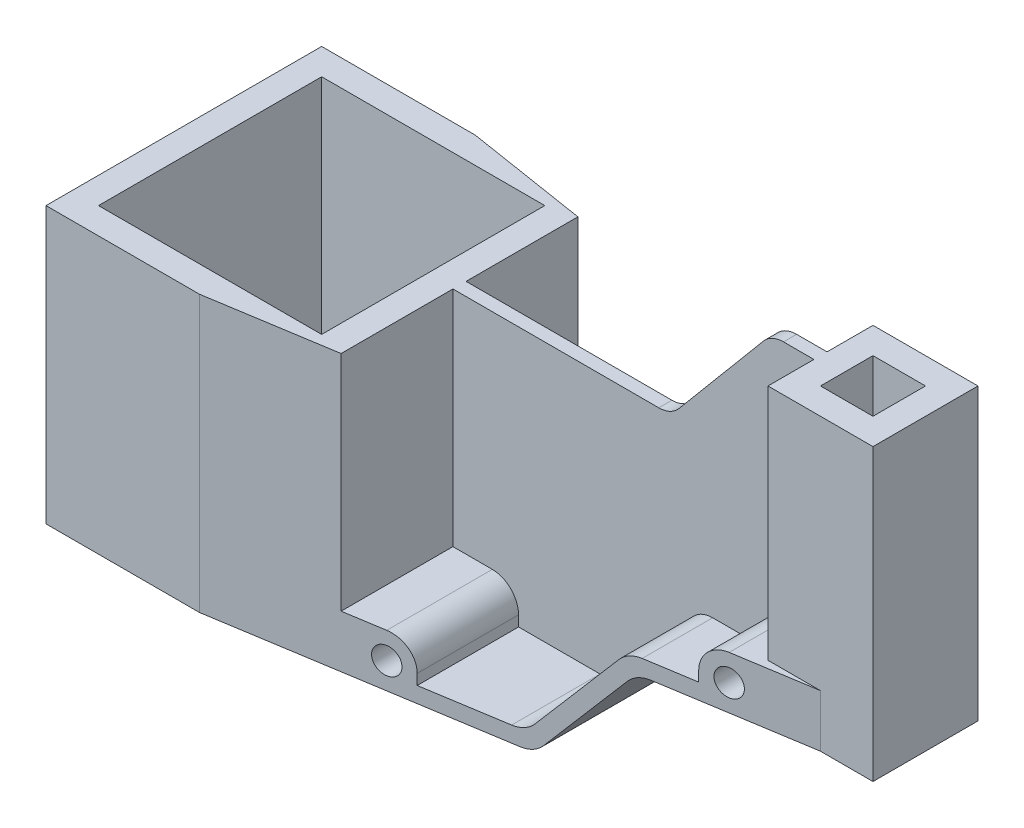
ISO-10303-21;
HEADER;
FILE_DESCRIPTION(('STEP AP214'),'2;1');
FILE_NAME('part.step','',(''),(''),'','','');
FILE_SCHEMA(('AUTOMOTIVE_DESIGN { 1 0 10303 214 1 1 1 1 }'));
ENDSEC;
DATA;
#1=APPLICATION_CONTEXT('core data for automotive mechanical design processes');
#2=APPLICATION_PROTOCOL_DEFINITION('international standard','automotive_design',2000,#1);
#3=PRODUCT_CONTEXT('',#1,'mechanical');
#4=PRODUCT('Part','Part','',(#3));
#5=PRODUCT_RELATED_PRODUCT_CATEGORY('part','',(#4));
#6=PRODUCT_DEFINITION_FORMATION('','',#4);
#7=PRODUCT_DEFINITION_CONTEXT('part definition',#1,'design');
#8=PRODUCT_DEFINITION('design','',#6,#7);
#9=PRODUCT_DEFINITION_SHAPE('','',#8);
#10=(LENGTH_UNIT() NAMED_UNIT(*) SI_UNIT(.MILLI.,.METRE.));
#11=(NAMED_UNIT(*) PLANE_ANGLE_UNIT() SI_UNIT($,.RADIAN.));
#12=(NAMED_UNIT(*) SI_UNIT($,.STERADIAN.) SOLID_ANGLE_UNIT());
#13=UNCERTAINTY_MEASURE_WITH_UNIT(LENGTH_MEASURE(1.E-05),#10,'distance_accuracy_value','');
#14=(GEOMETRIC_REPRESENTATION_CONTEXT(3) GLOBAL_UNCERTAINTY_ASSIGNED_CONTEXT((#13)) GLOBAL_UNIT_ASSIGNED_CONTEXT((#10,
#11,#12)) REPRESENTATION_CONTEXT('',''));
#15=CARTESIAN_POINT('',(0.,0.,0.));
#16=DIRECTION('',(0.,0.,1.));
#17=DIRECTION('',(1.,0.,0.));
#18=AXIS2_PLACEMENT_3D('',#15,#16,#17);
#19=CARTESIAN_POINT('',(0.,60.,52.5));
#20=DIRECTION('',(0.,-1.,0.));
#21=DIRECTION('',(0.,0.,-1.));
#22=AXIS2_PLACEMENT_3D('',#19,#20,#21);
#23=PLANE('',#22);
#24=DIRECTION('',(1.,0.,0.));
#25=VECTOR('',#24,1.);
#26=CARTESIAN_POINT('',(78.663955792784,60.,-2.5));
#27=LINE('',#26,#25);
#28=CARTESIAN_POINT('',(68.663955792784,60.,-2.5));
#29=VERTEX_POINT('',#28);
#30=CARTESIAN_POINT('',(78.663955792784,60.,-2.5));
#31=VERTEX_POINT('',#30);
#32=EDGE_CURVE('E516',#29,#31,#27,.T.);
#33=ORIENTED_EDGE('',*,*,#32,.T.);
#34=DIRECTION('',(0.,0.,1.));
#35=VECTOR('',#34,1.);
#36=CARTESIAN_POINT('',(78.663955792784,60.,20.));
#37=LINE('',#36,#35);
#38=CARTESIAN_POINT('',(78.663955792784,60.,-20.));
#39=VERTEX_POINT('',#38);
#40=EDGE_CURVE('E564',#39,#31,#37,.T.);
#41=ORIENTED_EDGE('',*,*,#40,.F.);
#42=DIRECTION('',(-1.,0.,0.));
#43=VECTOR('',#42,1.);
#44=CARTESIAN_POINT('',(78.663955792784,60.,-20.));
#45=LINE('',#44,#43);
#46=CARTESIAN_POINT('',(98.663955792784,60.,-20.));
#47=VERTEX_POINT('',#46);
#48=EDGE_CURVE('E547',#47,#39,#45,.T.);
#49=ORIENTED_EDGE('',*,*,#48,.F.);
#50=DIRECTION('',(0.987546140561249,0.,0.157329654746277));
#51=VECTOR('',#50,1.);
#52=CARTESIAN_POINT('',(13.7065376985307,60.,-33.5348827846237));
#53=LINE('',#52,#51);
#54=CARTESIAN_POINT('',(68.663955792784,60.,-24.7794117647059));
#55=VERTEX_POINT('',#54);
#56=EDGE_CURVE('E646',#55,#47,#53,.T.);
#57=ORIENTED_EDGE('',*,*,#56,.F.);
#58=DIRECTION('',(0.,0.,-1.));
#59=VECTOR('',#58,1.);
#60=CARTESIAN_POINT('',(68.663955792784,60.,52.5));
#61=LINE('',#60,#59);
#62=EDGE_CURVE('E49',#29,#55,#61,.T.);
#63=ORIENTED_EDGE('',*,*,#62,.F.);
#64=EDGE_LOOP('',(#33,#41,#49,#57,#63));
#65=FACE_BOUND('',#64,.T.);
#66=ADVANCED_FACE('F41',(#65),#23,.F.);
#67=CARTESIAN_POINT('',(68.663955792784,50.,52.5));
#68=DIRECTION('',(0.,0.,-1.));
#69=DIRECTION('',(-1.,0.,0.));
#70=AXIS2_PLACEMENT_3D('',#67,#68,#69);
#71=CYLINDRICAL_SURFACE('',#70,10.);
#72=CARTESIAN_POINT('',(68.663955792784,50.,-2.5));
#73=DIRECTION('',(0.,0.,-1.));
#74=DIRECTION('',(1.,0.,0.));
#75=AXIS2_PLACEMENT_3D('',#72,#73,#74);
#76=CIRCLE('',#75,10.);
#77=CARTESIAN_POINT('',(58.663955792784,50.,-2.5));
#78=VERTEX_POINT('',#77);
#79=EDGE_CURVE('E513',#78,#29,#76,.T.);
#80=ORIENTED_EDGE('',*,*,#79,.T.);
#81=ORIENTED_EDGE('',*,*,#62,.T.);
#82=CARTESIAN_POINT('',(68.663955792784,50.,-24.7794117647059));
#83=DIRECTION('',(0.157329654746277,0.,-0.987546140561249));
#84=DIRECTION('',(-0.987546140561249,0.,-0.157329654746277));
#85=AXIS2_PLACEMENT_3D('',#82,#83,#84);
#86=ELLIPSE('',#85,10.1261091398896,10.);
#87=CARTESIAN_POINT('',(58.663955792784,50.,-26.3725490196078));
#88=VERTEX_POINT('',#87);
#89=EDGE_CURVE('E643',#88,#55,#86,.T.);
#90=ORIENTED_EDGE('',*,*,#89,.F.);
#91=DIRECTION('',(0.,0.,-1.));
#92=VECTOR('',#91,1.);
#93=CARTESIAN_POINT('',(58.663955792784,50.,52.5));
#94=LINE('',#93,#92);
#95=EDGE_CURVE('E770',#78,#88,#94,.T.);
#96=ORIENTED_EDGE('',*,*,#95,.F.);
#97=EDGE_LOOP('',(#80,#81,#90,#96));
#98=FACE_BOUND('',#97,.T.);
#99=ADVANCED_FACE('F788',(#98),#71,.T.);
#100=CARTESIAN_POINT('',(58.663955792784,0.,52.5));
#101=DIRECTION('',(-1.,0.,0.));
#102=DIRECTION('',(0.,0.,1.));
#103=AXIS2_PLACEMENT_3D('',#100,#101,#102);
#104=PLANE('',#103);
#105=DIRECTION('',(0.,0.,-1.));
#106=VECTOR('',#105,1.);
#107=CARTESIAN_POINT('',(58.663955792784,46.,52.5));
#108=LINE('',#107,#106);
#109=CARTESIAN_POINT('',(58.663955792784,46.,-2.5));
#110=VERTEX_POINT('',#109);
#111=CARTESIAN_POINT('',(58.663955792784,46.,-26.3725490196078));
#112=VERTEX_POINT('',#111);
#113=EDGE_CURVE('E767',#110,#112,#108,.T.);
#114=ORIENTED_EDGE('',*,*,#113,.F.);
#115=DIRECTION('',(0.,1.,0.));
#116=VECTOR('',#115,1.);
#117=CARTESIAN_POINT('',(58.663955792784,46.,-2.5));
#118=LINE('',#117,#116);
#119=EDGE_CURVE('E510',#110,#78,#118,.T.);
#120=ORIENTED_EDGE('',*,*,#119,.T.);
#121=ORIENTED_EDGE('',*,*,#95,.T.);
#122=DIRECTION('',(0.,-1.,0.));
#123=VECTOR('',#122,1.);
#124=CARTESIAN_POINT('',(58.663955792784,0.,-26.3725490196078));
#125=LINE('',#124,#123);
#126=EDGE_CURVE('E640',#88,#112,#125,.T.);
#127=ORIENTED_EDGE('',*,*,#126,.T.);
#128=EDGE_LOOP('',(#114,#120,#121,#127));
#129=FACE_BOUND('',#128,.T.);
#130=ADVANCED_FACE('F780',(#129),#104,.T.);
#131=CARTESIAN_POINT('',(0.,46.,52.5));
#132=DIRECTION('',(0.,1.,0.));
#133=DIRECTION('',(-1.,0.,0.));
#134=AXIS2_PLACEMENT_3D('',#131,#132,#133);
#135=PLANE('',#134);
#136=DIRECTION('',(0.,0.,-1.));
#137=VECTOR('',#136,1.);
#138=CARTESIAN_POINT('',(40.092292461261,46.,52.5));
#139=LINE('',#138,#137);
#140=CARTESIAN_POINT('',(40.092292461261,46.,-2.5));
#141=VERTEX_POINT('',#140);
#142=CARTESIAN_POINT('',(40.092292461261,46.,-29.3312698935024));
#143=VERTEX_POINT('',#142);
#144=EDGE_CURVE('E763',#141,#143,#139,.T.);
#145=ORIENTED_EDGE('',*,*,#144,.F.);
#146=DIRECTION('',(1.,0.,0.));
#147=VECTOR('',#146,1.);
#148=CARTESIAN_POINT('',(40.092292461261,46.,-2.5));
#149=LINE('',#148,#147);
#150=EDGE_CURVE('E507',#141,#110,#149,.T.);
#151=ORIENTED_EDGE('',*,*,#150,.T.);
#152=ORIENTED_EDGE('',*,*,#113,.T.);
#153=DIRECTION('',(-0.987546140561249,0.,-0.157329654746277));
#154=VECTOR('',#153,1.);
#155=CARTESIAN_POINT('',(13.7065376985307,46.,-33.5348827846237));
#156=LINE('',#155,#154);
#157=EDGE_CURVE('E637',#112,#143,#156,.T.);
#158=ORIENTED_EDGE('',*,*,#157,.T.);
#159=EDGE_LOOP('',(#145,#151,#152,#158));
#160=FACE_BOUND('',#159,.T.);
#161=ADVANCED_FACE('F857',(#160),#135,.T.);
#162=CARTESIAN_POINT('',(40.092292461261,36.,52.5));
#163=DIRECTION('',(0.,0.,-1.));
#164=DIRECTION('',(-1.,0.,0.));
#165=AXIS2_PLACEMENT_3D('',#162,#163,#164);
#166=CYLINDRICAL_SURFACE('',#165,9.99999999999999);
#167=DIRECTION('',(0.,0.,-1.));
#168=VECTOR('',#167,1.);
#169=CARTESIAN_POINT('',(32.4318480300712,42.4278760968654,52.5));
#170=LINE('',#169,#168);
#171=CARTESIAN_POINT('',(32.4318480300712,42.4278760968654,-2.5));
#172=VERTEX_POINT('',#171);
#173=CARTESIAN_POINT('',(32.4318480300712,42.4278760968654,-30.5516838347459));
#174=VERTEX_POINT('',#173);
#175=EDGE_CURVE('E759',#172,#174,#170,.T.);
#176=ORIENTED_EDGE('',*,*,#175,.F.);
#177=CARTESIAN_POINT('',(40.092292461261,36.,-2.5));
#178=DIRECTION('',(0.,0.,-1.));
#179=DIRECTION('',(1.,0.,0.));
#180=AXIS2_PLACEMENT_3D('',#177,#178,#179);
#181=CIRCLE('',#180,9.99999999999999);
#182=EDGE_CURVE('E504',#172,#141,#181,.T.);
#183=ORIENTED_EDGE('',*,*,#182,.T.);
#184=ORIENTED_EDGE('',*,*,#144,.T.);
#185=CARTESIAN_POINT('',(40.092292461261,36.,-29.3312698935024));
#186=DIRECTION('',(0.157329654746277,0.,-0.987546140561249));
#187=DIRECTION('',(-0.987546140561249,0.,-0.157329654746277));
#188=AXIS2_PLACEMENT_3D('',#185,#186,#187);
#189=ELLIPSE('',#188,10.1261091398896,9.99999999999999);
#190=EDGE_CURVE('E634',#143,#174,#189,.F.);
#191=ORIENTED_EDGE('',*,*,#190,.T.);
#192=EDGE_LOOP('',(#176,#183,#184,#191));
#193=FACE_BOUND('',#192,.T.);
#194=ADVANCED_FACE('F854',(#193),#166,.T.);
#195=CARTESIAN_POINT('',(-1.85986099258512,1.56060867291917,52.5));
#196=DIRECTION('',(-0.76604444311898,0.642787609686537,0.));
#197=DIRECTION('',(-0.642787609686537,-0.76604444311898,0.));
#198=AXIS2_PLACEMENT_3D('',#195,#196,#197);
#199=PLANE('',#198);
#200=DIRECTION('',(0.,0.,-1.));
#201=VECTOR('',#200,1.);
#202=CARTESIAN_POINT('',(4.8625984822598,9.57212390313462,52.5));
#203=LINE('',#202,#201);
#204=CARTESIAN_POINT('',(4.86259848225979,9.57212390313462,-2.5));
#205=VERTEX_POINT('',#204);
#206=CARTESIAN_POINT('',(4.8625984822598,9.57212390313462,-34.9438436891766));
#207=VERTEX_POINT('',#206);
#208=EDGE_CURVE('E755',#205,#207,#203,.T.);
#209=ORIENTED_EDGE('',*,*,#208,.F.);
#210=DIRECTION('',(0.642787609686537,0.76604444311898,0.));
#211=VECTOR('',#210,1.);
#212=CARTESIAN_POINT('',(4.86259848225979,9.57212390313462,-2.5));
#213=LINE('',#212,#211);
#214=EDGE_CURVE('E501',#205,#172,#213,.T.);
#215=ORIENTED_EDGE('',*,*,#214,.T.);
#216=ORIENTED_EDGE('',*,*,#175,.T.);
#217=DIRECTION('',(-0.639443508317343,-0.762059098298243,-0.101872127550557));
#218=VECTOR('',#217,1.);
#219=CARTESIAN_POINT('',(3.90612480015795,8.43224295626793,-35.0962230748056));
#220=LINE('',#219,#218);
#221=EDGE_CURVE('E631',#174,#207,#220,.T.);
#222=ORIENTED_EDGE('',*,*,#221,.T.);
#223=EDGE_LOOP('',(#209,#215,#216,#222));
#224=FACE_BOUND('',#223,.T.);
#225=ADVANCED_FACE('F851',(#224),#199,.T.);
#226=CARTESIAN_POINT('',(-2.79784594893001,16.,52.5));
#227=DIRECTION('',(0.,0.,-1.));
#228=DIRECTION('',(-1.,0.,0.));
#229=AXIS2_PLACEMENT_3D('',#226,#227,#228);
#230=CYLINDRICAL_SURFACE('',#229,10.);
#231=DIRECTION('',(0.,0.,-1.));
#232=VECTOR('',#231,1.);
#233=CARTESIAN_POINT('',(-2.79784594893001,6.,52.5));
#234=LINE('',#233,#232);
#235=CARTESIAN_POINT('',(-2.79784594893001,6.,-2.5));
#236=VERTEX_POINT('',#235);
#237=CARTESIAN_POINT('',(-2.79784594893,6.,-36.1642576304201));
#238=VERTEX_POINT('',#237);
#239=EDGE_CURVE('E751',#236,#238,#234,.T.);
#240=ORIENTED_EDGE('',*,*,#239,.F.);
#241=CARTESIAN_POINT('',(-2.79784594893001,16.,-2.5));
#242=DIRECTION('',(0.,0.,1.));
#243=DIRECTION('',(1.,0.,0.));
#244=AXIS2_PLACEMENT_3D('',#241,#242,#243);
#245=CIRCLE('',#244,10.);
#246=EDGE_CURVE('E498',#236,#205,#245,.T.);
#247=ORIENTED_EDGE('',*,*,#246,.T.);
#248=ORIENTED_EDGE('',*,*,#208,.T.);
#249=CARTESIAN_POINT('',(-2.79784594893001,16.,-36.1642576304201));
#250=DIRECTION('',(0.157329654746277,0.,-0.987546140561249));
#251=DIRECTION('',(-0.987546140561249,0.,-0.157329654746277));
#252=AXIS2_PLACEMENT_3D('',#249,#250,#251);
#253=ELLIPSE('',#252,10.1261091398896,10.);
#254=EDGE_CURVE('E628',#207,#238,#253,.T.);
#255=ORIENTED_EDGE('',*,*,#254,.T.);
#256=EDGE_LOOP('',(#240,#247,#248,#255));
#257=FACE_BOUND('',#256,.T.);
#258=ADVANCED_FACE('F848',(#257),#230,.F.);
#259=CARTESIAN_POINT('',(0.,6.,52.5));
#260=DIRECTION('',(0.,1.,0.));
#261=DIRECTION('',(-1.,0.,0.));
#262=AXIS2_PLACEMENT_3D('',#259,#260,#261);
#263=PLANE('',#262);
#264=DIRECTION('',(0.,0.,-1.));
#265=VECTOR('',#264,1.);
#266=CARTESIAN_POINT('',(-33.836044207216,6.,52.5));
#267=LINE('',#266,#265);
#268=CARTESIAN_POINT('',(-33.836044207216,6.,-2.5));
#269=VERTEX_POINT('',#268);
#270=CARTESIAN_POINT('',(-33.836044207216,6.,-41.1090686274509));
#271=VERTEX_POINT('',#270);
#272=EDGE_CURVE('E747',#269,#271,#267,.T.);
#273=ORIENTED_EDGE('',*,*,#272,.F.);
#274=DIRECTION('',(1.,0.,0.));
#275=VECTOR('',#274,1.);
#276=CARTESIAN_POINT('',(-33.836044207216,6.,-2.5));
#277=LINE('',#276,#275);
#278=EDGE_CURVE('E495',#269,#236,#277,.T.);
#279=ORIENTED_EDGE('',*,*,#278,.T.);
#280=ORIENTED_EDGE('',*,*,#239,.T.);
#281=DIRECTION('',(-0.987546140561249,0.,-0.157329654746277));
#282=VECTOR('',#281,1.);
#283=CARTESIAN_POINT('',(13.7065376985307,6.,-33.5348827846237));
#284=LINE('',#283,#282);
#285=EDGE_CURVE('E625',#238,#271,#284,.T.);
#286=ORIENTED_EDGE('',*,*,#285,.T.);
#287=EDGE_LOOP('',(#273,#279,#280,#286));
#288=FACE_BOUND('',#287,.T.);
#289=ADVANCED_FACE('F843',(#288),#263,.T.);
#290=CARTESIAN_POINT('',(-33.836044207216,0.,52.5));
#291=DIRECTION('',(1.,0.,0.));
#292=DIRECTION('',(0.,0.,-1.));
#293=AXIS2_PLACEMENT_3D('',#290,#291,#292);
#294=PLANE('',#293);
#295=DIRECTION('',(0.,0.,-1.));
#296=VECTOR('',#295,1.);
#297=CARTESIAN_POINT('',(-33.836044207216,10.,52.5));
#298=LINE('',#297,#296);
#299=CARTESIAN_POINT('',(-33.836044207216,10.,-2.5));
#300=VERTEX_POINT('',#299);
#301=CARTESIAN_POINT('',(-33.836044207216,10.,-41.1090686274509));
#302=VERTEX_POINT('',#301);
#303=EDGE_CURVE('E743',#300,#302,#298,.T.);
#304=ORIENTED_EDGE('',*,*,#303,.F.);
#305=DIRECTION('',(0.,-1.,0.));
#306=VECTOR('',#305,1.);
#307=CARTESIAN_POINT('',(-33.836044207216,10.,-2.5));
#308=LINE('',#307,#306);
#309=EDGE_CURVE('E492',#300,#269,#308,.T.);
#310=ORIENTED_EDGE('',*,*,#309,.T.);
#311=ORIENTED_EDGE('',*,*,#272,.T.);
#312=DIRECTION('',(0.,1.,0.));
#313=VECTOR('',#312,1.);
#314=CARTESIAN_POINT('',(-33.836044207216,0.,-41.1090686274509));
#315=LINE('',#314,#313);
#316=EDGE_CURVE('E622',#271,#302,#315,.T.);
#317=ORIENTED_EDGE('',*,*,#316,.T.);
#318=EDGE_LOOP('',(#304,#310,#311,#317));
#319=FACE_BOUND('',#318,.T.);
#320=ADVANCED_FACE('F840',(#319),#294,.T.);
#321=CARTESIAN_POINT('',(-43.836044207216,9.99999999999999,52.5));
#322=DIRECTION('',(0.,0.,-1.));
#323=DIRECTION('',(-1.,0.,0.));
#324=AXIS2_PLACEMENT_3D('',#321,#322,#323);
#325=CYLINDRICAL_SURFACE('',#324,9.99999999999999);
#326=DIRECTION('',(0.,0.,-1.));
#327=VECTOR('',#326,1.);
#328=CARTESIAN_POINT('',(-43.836044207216,20.,52.5));
#329=LINE('',#328,#327);
#330=CARTESIAN_POINT('',(-43.836044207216,20.,-2.5));
#331=VERTEX_POINT('',#330);
#332=CARTESIAN_POINT('',(-43.836044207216,20.,-42.7022058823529));
#333=VERTEX_POINT('',#332);
#334=EDGE_CURVE('E739',#331,#333,#329,.T.);
#335=ORIENTED_EDGE('',*,*,#334,.F.);
#336=CARTESIAN_POINT('',(-43.836044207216,9.99999999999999,-2.5));
#337=DIRECTION('',(0.,0.,-1.));
#338=DIRECTION('',(1.,0.,0.));
#339=AXIS2_PLACEMENT_3D('',#336,#337,#338);
#340=CIRCLE('',#339,9.99999999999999);
#341=EDGE_CURVE('E489',#331,#300,#340,.T.);
#342=ORIENTED_EDGE('',*,*,#341,.T.);
#343=ORIENTED_EDGE('',*,*,#303,.T.);
#344=CARTESIAN_POINT('',(-43.836044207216,9.99999999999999,-42.7022058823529));
#345=DIRECTION('',(0.157329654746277,0.,-0.987546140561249));
#346=DIRECTION('',(-0.987546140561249,0.,-0.157329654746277));
#347=AXIS2_PLACEMENT_3D('',#344,#345,#346);
#348=ELLIPSE('',#347,10.1261091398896,9.99999999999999);
#349=EDGE_CURVE('E619',#302,#333,#348,.F.);
#350=ORIENTED_EDGE('',*,*,#349,.T.);
#351=EDGE_LOOP('',(#335,#342,#343,#350));
#352=FACE_BOUND('',#351,.T.);
#353=ADVANCED_FACE('F835',(#352),#325,.T.);
#354=CARTESIAN_POINT('',(0.,20.,52.5));
#355=DIRECTION('',(0.,1.,0.));
#356=DIRECTION('',(-1.,0.,0.));
#357=AXIS2_PLACEMENT_3D('',#354,#355,#356);
#358=PLANE('',#357);
#359=DIRECTION('',(0.,0.,-1.));
#360=VECTOR('',#359,1.);
#361=CARTESIAN_POINT('',(-58.836044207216,20.,52.5));
#362=LINE('',#361,#360);
#363=CARTESIAN_POINT('',(-58.836044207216,20.,-2.5));
#364=VERTEX_POINT('',#363);
#365=CARTESIAN_POINT('',(-58.836044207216,20.,-45.0919117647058));
#366=VERTEX_POINT('',#365);
#367=EDGE_CURVE('E735',#364,#366,#362,.T.);
#368=ORIENTED_EDGE('',*,*,#367,.F.);
#369=DIRECTION('',(1.,0.,0.));
#370=VECTOR('',#369,1.);
#371=CARTESIAN_POINT('',(-58.836044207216,20.,-2.5));
#372=LINE('',#371,#370);
#373=EDGE_CURVE('E486',#364,#331,#372,.T.);
#374=ORIENTED_EDGE('',*,*,#373,.T.);
#375=ORIENTED_EDGE('',*,*,#334,.T.);
#376=DIRECTION('',(-0.987546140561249,0.,-0.157329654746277));
#377=VECTOR('',#376,1.);
#378=CARTESIAN_POINT('',(13.7065376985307,20.,-33.5348827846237));
#379=LINE('',#378,#377);
#380=EDGE_CURVE('E616',#333,#366,#379,.T.);
#381=ORIENTED_EDGE('',*,*,#380,.T.);
#382=EDGE_LOOP('',(#368,#374,#375,#381));
#383=FACE_BOUND('',#382,.T.);
#384=ADVANCED_FACE('F832',(#383),#358,.T.);
#385=CARTESIAN_POINT('',(-58.836044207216,0.,52.5));
#386=DIRECTION('',(1.,0.,0.));
#387=DIRECTION('',(0.,0.,-1.));
#388=AXIS2_PLACEMENT_3D('',#385,#386,#387);
#389=PLANE('',#388);
#390=DIRECTION('',(0.,0.,-1.));
#391=VECTOR('',#390,1.);
#392=CARTESIAN_POINT('',(-58.836044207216,105.,52.5));
#393=LINE('',#392,#391);
#394=CARTESIAN_POINT('',(-58.836044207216,105.,-2.5));
#395=VERTEX_POINT('',#394);
#396=CARTESIAN_POINT('',(-58.836044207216,105.,-45.0919117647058));
#397=VERTEX_POINT('',#396);
#398=EDGE_CURVE('E731',#395,#397,#393,.T.);
#399=ORIENTED_EDGE('',*,*,#398,.F.);
#400=DIRECTION('',(0.,-1.,0.));
#401=VECTOR('',#400,1.);
#402=CARTESIAN_POINT('',(-58.836044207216,105.,-2.5));
#403=LINE('',#402,#401);
#404=EDGE_CURVE('E483',#395,#364,#403,.T.);
#405=ORIENTED_EDGE('',*,*,#404,.T.);
#406=ORIENTED_EDGE('',*,*,#367,.T.);
#407=DIRECTION('',(0.,1.,0.));
#408=VECTOR('',#407,1.);
#409=CARTESIAN_POINT('',(-58.836044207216,0.,-45.0919117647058));
#410=LINE('',#409,#408);
#411=EDGE_CURVE('E613',#366,#397,#410,.T.);
#412=ORIENTED_EDGE('',*,*,#411,.T.);
#413=EDGE_LOOP('',(#399,#405,#406,#412));
#414=FACE_BOUND('',#413,.T.);
#415=ADVANCED_FACE('F827',(#414),#389,.T.);
#416=CARTESIAN_POINT('',(78.663955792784,150.5,20.));
#417=DIRECTION('',(1.,0.,0.));
#418=DIRECTION('',(0.,0.,-1.));
#419=AXIS2_PLACEMENT_3D('',#416,#417,#418);
#420=PLANE('',#419);
#421=DIRECTION('',(0.,1.,0.));
#422=VECTOR('',#421,1.);
#423=CARTESIAN_POINT('',(78.663955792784,150.5,-2.5));
#424=LINE('',#423,#422);
#425=CARTESIAN_POINT('',(78.663955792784,150.5,-2.5));
#426=VERTEX_POINT('',#425);
#427=EDGE_CURVE('E519',#31,#426,#424,.T.);
#428=ORIENTED_EDGE('',*,*,#427,.T.);
#429=DIRECTION('',(0.,0.,1.));
#430=VECTOR('',#429,1.);
#431=CARTESIAN_POINT('',(78.663955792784,150.5,20.));
#432=LINE('',#431,#430);
#433=CARTESIAN_POINT('',(78.663955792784,150.5,-20.));
#434=VERTEX_POINT('',#433);
#435=EDGE_CURVE('E555',#434,#426,#432,.T.);
#436=ORIENTED_EDGE('',*,*,#435,.F.);
#437=DIRECTION('',(0.,-1.,0.));
#438=VECTOR('',#437,1.);
#439=CARTESIAN_POINT('',(78.663955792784,150.5,-20.));
#440=LINE('',#439,#438);
#441=EDGE_CURVE('E573',#434,#39,#440,.T.);
#442=ORIENTED_EDGE('',*,*,#441,.T.);
#443=ORIENTED_EDGE('',*,*,#40,.T.);
#444=EDGE_LOOP('',(#428,#436,#442,#443));
#445=FACE_BOUND('',#444,.T.);
#446=ADVANCED_FACE('F864',(#445),#420,.F.);
#447=CARTESIAN_POINT('',(78.663955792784,60.,2.5));
#448=VERTEX_POINT('',#447);
#449=CARTESIAN_POINT('',(78.663955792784,60.,20.));
#450=VERTEX_POINT('',#449);
#451=EDGE_CURVE('E563',#448,#450,#37,.T.);
#452=ORIENTED_EDGE('',*,*,#451,.F.);
#453=DIRECTION('',(1.,0.,0.));
#454=VECTOR('',#453,1.);
#455=CARTESIAN_POINT('',(78.663955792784,60.,2.5));
#456=LINE('',#455,#454);
#457=CARTESIAN_POINT('',(68.663955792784,60.,2.5));
#458=VERTEX_POINT('',#457);
#459=EDGE_CURVE('E467',#458,#448,#456,.T.);
#460=ORIENTED_EDGE('',*,*,#459,.F.);
#461=CARTESIAN_POINT('',(68.663955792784,60.,24.7794117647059));
#462=VERTEX_POINT('',#461);
#463=EDGE_CURVE('E11',#462,#458,#61,.T.);
#464=ORIENTED_EDGE('',*,*,#463,.F.);
#465=DIRECTION('',(-0.987546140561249,0.,0.157329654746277));
#466=VECTOR('',#465,1.);
#467=CARTESIAN_POINT('',(-2.60734310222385,60.,36.1339079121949));
#468=LINE('',#467,#466);
#469=CARTESIAN_POINT('',(98.663955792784,60.,20.));
#470=VERTEX_POINT('',#469);
#471=EDGE_CURVE('E696',#470,#462,#468,.T.);
#472=ORIENTED_EDGE('',*,*,#471,.F.);
#473=DIRECTION('',(1.,0.,0.));
#474=VECTOR('',#473,1.);
#475=CARTESIAN_POINT('',(78.663955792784,60.,20.));
#476=LINE('',#475,#474);
#477=EDGE_CURVE('E552',#450,#470,#476,.T.);
#478=ORIENTED_EDGE('',*,*,#477,.F.);
#479=EDGE_LOOP('',(#452,#460,#464,#472,#478));
#480=FACE_BOUND('',#479,.T.);
#481=ADVANCED_FACE('F888',(#480),#23,.F.);
#482=ORIENTED_EDGE('',*,*,#463,.T.);
#483=CARTESIAN_POINT('',(68.663955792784,50.,2.5));
#484=DIRECTION('',(0.,0.,-1.));
#485=DIRECTION('',(1.,0.,0.));
#486=AXIS2_PLACEMENT_3D('',#483,#484,#485);
#487=CIRCLE('',#486,10.);
#488=CARTESIAN_POINT('',(58.663955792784,50.,2.5));
#489=VERTEX_POINT('',#488);
#490=EDGE_CURVE('E465',#489,#458,#487,.T.);
#491=ORIENTED_EDGE('',*,*,#490,.F.);
#492=CARTESIAN_POINT('',(58.663955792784,50.,26.3725490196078));
#493=VERTEX_POINT('',#492);
#494=EDGE_CURVE('E771',#493,#489,#94,.T.);
#495=ORIENTED_EDGE('',*,*,#494,.F.);
#496=CARTESIAN_POINT('',(68.663955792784,50.,24.7794117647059));
#497=DIRECTION('',(0.157329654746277,0.,0.987546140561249));
#498=DIRECTION('',(0.987546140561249,0.,-0.157329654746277));
#499=AXIS2_PLACEMENT_3D('',#496,#497,#498);
#500=ELLIPSE('',#499,10.1261091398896,10.);
#501=EDGE_CURVE('E694',#462,#493,#500,.T.);
#502=ORIENTED_EDGE('',*,*,#501,.F.);
#503=EDGE_LOOP('',(#482,#491,#495,#502));
#504=FACE_BOUND('',#503,.T.);
#505=ADVANCED_FACE('F893',(#504),#71,.T.);
#506=DIRECTION('',(0.,1.,0.));
#507=VECTOR('',#506,1.);
#508=CARTESIAN_POINT('',(58.663955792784,46.,2.5));
#509=LINE('',#508,#507);
#510=CARTESIAN_POINT('',(58.663955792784,46.,2.5));
#511=VERTEX_POINT('',#510);
#512=EDGE_CURVE('E463',#511,#489,#509,.T.);
#513=ORIENTED_EDGE('',*,*,#512,.F.);
#514=CARTESIAN_POINT('',(58.663955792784,46.,26.3725490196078));
#515=VERTEX_POINT('',#514);
#516=EDGE_CURVE('E768',#515,#511,#108,.T.);
#517=ORIENTED_EDGE('',*,*,#516,.F.);
#518=DIRECTION('',(0.,1.,0.));
#519=VECTOR('',#518,1.);
#520=CARTESIAN_POINT('',(58.663955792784,0.,26.3725490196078));
#521=LINE('',#520,#519);
#522=EDGE_CURVE('E691',#515,#493,#521,.T.);
#523=ORIENTED_EDGE('',*,*,#522,.T.);
#524=ORIENTED_EDGE('',*,*,#494,.T.);
#525=EDGE_LOOP('',(#513,#517,#523,#524));
#526=FACE_BOUND('',#525,.T.);
#527=ADVANCED_FACE('F900',(#526),#104,.T.);
#528=DIRECTION('',(1.,0.,0.));
#529=VECTOR('',#528,1.);
#530=CARTESIAN_POINT('',(40.092292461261,46.,2.5));
#531=LINE('',#530,#529);
#532=CARTESIAN_POINT('',(40.092292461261,46.,2.5));
#533=VERTEX_POINT('',#532);
#534=EDGE_CURVE('E461',#533,#511,#531,.T.);
#535=ORIENTED_EDGE('',*,*,#534,.F.);
#536=CARTESIAN_POINT('',(40.092292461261,46.,29.3312698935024));
#537=VERTEX_POINT('',#536);
#538=EDGE_CURVE('E764',#537,#533,#139,.T.);
#539=ORIENTED_EDGE('',*,*,#538,.F.);
#540=DIRECTION('',(0.987546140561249,0.,-0.157329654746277));
#541=VECTOR('',#540,1.);
#542=CARTESIAN_POINT('',(-2.60734310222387,46.,36.1339079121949));
#543=LINE('',#542,#541);
#544=EDGE_CURVE('E688',#537,#515,#543,.T.);
#545=ORIENTED_EDGE('',*,*,#544,.T.);
#546=ORIENTED_EDGE('',*,*,#516,.T.);
#547=EDGE_LOOP('',(#535,#539,#545,#546));
#548=FACE_BOUND('',#547,.T.);
#549=ADVANCED_FACE('F968',(#548),#135,.T.);
#550=CARTESIAN_POINT('',(40.092292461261,36.,2.5));
#551=DIRECTION('',(0.,0.,-1.));
#552=DIRECTION('',(1.,0.,0.));
#553=AXIS2_PLACEMENT_3D('',#550,#551,#552);
#554=CIRCLE('',#553,9.99999999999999);
#555=CARTESIAN_POINT('',(32.4318480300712,42.4278760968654,2.5));
#556=VERTEX_POINT('',#555);
#557=EDGE_CURVE('E459',#556,#533,#554,.T.);
#558=ORIENTED_EDGE('',*,*,#557,.F.);
#559=CARTESIAN_POINT('',(32.4318480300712,42.4278760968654,30.5516838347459));
#560=VERTEX_POINT('',#559);
#561=EDGE_CURVE('E760',#560,#556,#170,.T.);
#562=ORIENTED_EDGE('',*,*,#561,.F.);
#563=CARTESIAN_POINT('',(40.092292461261,36.,29.3312698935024));
#564=DIRECTION('',(0.157329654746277,0.,0.987546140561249));
#565=DIRECTION('',(0.987546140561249,0.,-0.157329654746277));
#566=AXIS2_PLACEMENT_3D('',#563,#564,#565);
#567=ELLIPSE('',#566,10.1261091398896,9.99999999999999);
#568=EDGE_CURVE('E685',#560,#537,#567,.F.);
#569=ORIENTED_EDGE('',*,*,#568,.T.);
#570=ORIENTED_EDGE('',*,*,#538,.T.);
#571=EDGE_LOOP('',(#558,#562,#569,#570));
#572=FACE_BOUND('',#571,.T.);
#573=ADVANCED_FACE('F964',(#572),#166,.T.);
#574=DIRECTION('',(0.642787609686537,0.76604444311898,0.));
#575=VECTOR('',#574,1.);
#576=CARTESIAN_POINT('',(4.86259848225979,9.57212390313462,2.5));
#577=LINE('',#576,#575);
#578=CARTESIAN_POINT('',(4.86259848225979,9.57212390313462,2.5));
#579=VERTEX_POINT('',#578);
#580=EDGE_CURVE('E457',#579,#556,#577,.T.);
#581=ORIENTED_EDGE('',*,*,#580,.F.);
#582=CARTESIAN_POINT('',(4.8625984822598,9.57212390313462,34.9438436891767));
#583=VERTEX_POINT('',#582);
#584=EDGE_CURVE('E756',#583,#579,#203,.T.);
#585=ORIENTED_EDGE('',*,*,#584,.F.);
#586=DIRECTION('',(0.639443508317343,0.762059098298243,-0.101872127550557));
#587=VECTOR('',#586,1.);
#588=CARTESIAN_POINT('',(-2.93372961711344,0.280821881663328,36.1859057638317));
#589=LINE('',#588,#587);
#590=EDGE_CURVE('E682',#583,#560,#589,.T.);
#591=ORIENTED_EDGE('',*,*,#590,.T.);
#592=ORIENTED_EDGE('',*,*,#561,.T.);
#593=EDGE_LOOP('',(#581,#585,#591,#592));
#594=FACE_BOUND('',#593,.T.);
#595=ADVANCED_FACE('F961',(#594),#199,.T.);
#596=CARTESIAN_POINT('',(-2.79784594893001,16.,2.5));
#597=DIRECTION('',(0.,0.,1.));
#598=DIRECTION('',(1.,0.,0.));
#599=AXIS2_PLACEMENT_3D('',#596,#597,#598);
#600=CIRCLE('',#599,10.);
#601=CARTESIAN_POINT('',(-2.79784594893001,6.,2.5));
#602=VERTEX_POINT('',#601);
#603=EDGE_CURVE('E455',#602,#579,#600,.T.);
#604=ORIENTED_EDGE('',*,*,#603,.F.);
#605=CARTESIAN_POINT('',(-2.79784594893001,6.,36.1642576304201));
#606=VERTEX_POINT('',#605);
#607=EDGE_CURVE('E752',#606,#602,#234,.T.);
#608=ORIENTED_EDGE('',*,*,#607,.F.);
#609=CARTESIAN_POINT('',(-2.79784594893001,16.,36.1642576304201));
#610=DIRECTION('',(0.157329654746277,0.,0.987546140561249));
#611=DIRECTION('',(0.987546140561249,0.,-0.157329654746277));
#612=AXIS2_PLACEMENT_3D('',#609,#610,#611);
#613=ELLIPSE('',#612,10.1261091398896,10.);
#614=EDGE_CURVE('E679',#606,#583,#613,.T.);
#615=ORIENTED_EDGE('',*,*,#614,.T.);
#616=ORIENTED_EDGE('',*,*,#584,.T.);
#617=EDGE_LOOP('',(#604,#608,#615,#616));
#618=FACE_BOUND('',#617,.T.);
#619=ADVANCED_FACE('F956',(#618),#230,.F.);
#620=DIRECTION('',(1.,0.,0.));
#621=VECTOR('',#620,1.);
#622=CARTESIAN_POINT('',(-33.836044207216,6.,2.5));
#623=LINE('',#622,#621);
#624=CARTESIAN_POINT('',(-33.836044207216,6.,2.5));
#625=VERTEX_POINT('',#624);
#626=EDGE_CURVE('E453',#625,#602,#623,.T.);
#627=ORIENTED_EDGE('',*,*,#626,.F.);
#628=CARTESIAN_POINT('',(-33.836044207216,6.,41.109068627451));
#629=VERTEX_POINT('',#628);
#630=EDGE_CURVE('E748',#629,#625,#267,.T.);
#631=ORIENTED_EDGE('',*,*,#630,.F.);
#632=DIRECTION('',(0.987546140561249,0.,-0.157329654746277));
#633=VECTOR('',#632,1.);
#634=CARTESIAN_POINT('',(-2.60734310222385,6.,36.1339079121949));
#635=LINE('',#634,#633);
#636=EDGE_CURVE('E676',#629,#606,#635,.T.);
#637=ORIENTED_EDGE('',*,*,#636,.T.);
#638=ORIENTED_EDGE('',*,*,#607,.T.);
#639=EDGE_LOOP('',(#627,#631,#637,#638));
#640=FACE_BOUND('',#639,.T.);
#641=ADVANCED_FACE('F953',(#640),#263,.T.);
#642=DIRECTION('',(0.,-1.,0.));
#643=VECTOR('',#642,1.);
#644=CARTESIAN_POINT('',(-33.836044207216,10.,2.5));
#645=LINE('',#644,#643);
#646=CARTESIAN_POINT('',(-33.836044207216,10.,2.5));
#647=VERTEX_POINT('',#646);
#648=EDGE_CURVE('E451',#647,#625,#645,.T.);
#649=ORIENTED_EDGE('',*,*,#648,.F.);
#650=CARTESIAN_POINT('',(-33.836044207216,10.,41.109068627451));
#651=VERTEX_POINT('',#650);
#652=EDGE_CURVE('E744',#651,#647,#298,.T.);
#653=ORIENTED_EDGE('',*,*,#652,.F.);
#654=DIRECTION('',(0.,-1.,0.));
#655=VECTOR('',#654,1.);
#656=CARTESIAN_POINT('',(-33.836044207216,0.,41.109068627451));
#657=LINE('',#656,#655);
#658=EDGE_CURVE('E673',#651,#629,#657,.T.);
#659=ORIENTED_EDGE('',*,*,#658,.T.);
#660=ORIENTED_EDGE('',*,*,#630,.T.);
#661=EDGE_LOOP('',(#649,#653,#659,#660));
#662=FACE_BOUND('',#661,.T.);
#663=ADVANCED_FACE('F948',(#662),#294,.T.);
#664=CARTESIAN_POINT('',(-43.836044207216,9.99999999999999,2.5));
#665=DIRECTION('',(0.,0.,-1.));
#666=DIRECTION('',(1.,0.,0.));
#667=AXIS2_PLACEMENT_3D('',#664,#665,#666);
#668=CIRCLE('',#667,9.99999999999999);
#669=CARTESIAN_POINT('',(-43.836044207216,20.,2.5));
#670=VERTEX_POINT('',#669);
#671=EDGE_CURVE('E449',#670,#647,#668,.T.);
#672=ORIENTED_EDGE('',*,*,#671,.F.);
#673=CARTESIAN_POINT('',(-43.836044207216,20.,42.7022058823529));
#674=VERTEX_POINT('',#673);
#675=EDGE_CURVE('E740',#674,#670,#329,.T.);
#676=ORIENTED_EDGE('',*,*,#675,.F.);
#677=CARTESIAN_POINT('',(-43.836044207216,9.99999999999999,42.7022058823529));
#678=DIRECTION('',(0.157329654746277,0.,0.987546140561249));
#679=DIRECTION('',(0.987546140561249,0.,-0.157329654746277));
#680=AXIS2_PLACEMENT_3D('',#677,#678,#679);
#681=ELLIPSE('',#680,10.1261091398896,9.99999999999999);
#682=EDGE_CURVE('E670',#674,#651,#681,.F.);
#683=ORIENTED_EDGE('',*,*,#682,.T.);
#684=ORIENTED_EDGE('',*,*,#652,.T.);
#685=EDGE_LOOP('',(#672,#676,#683,#684));
#686=FACE_BOUND('',#685,.T.);
#687=ADVANCED_FACE('F945',(#686),#325,.T.);
#688=DIRECTION('',(1.,0.,0.));
#689=VECTOR('',#688,1.);
#690=CARTESIAN_POINT('',(-58.836044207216,20.,2.5));
#691=LINE('',#690,#689);
#692=CARTESIAN_POINT('',(-58.836044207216,20.,2.5));
#693=VERTEX_POINT('',#692);
#694=EDGE_CURVE('E447',#693,#670,#691,.T.);
#695=ORIENTED_EDGE('',*,*,#694,.F.);
#696=CARTESIAN_POINT('',(-58.836044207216,20.,45.0919117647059));
#697=VERTEX_POINT('',#696);
#698=EDGE_CURVE('E736',#697,#693,#362,.T.);
#699=ORIENTED_EDGE('',*,*,#698,.F.);
#700=DIRECTION('',(0.987546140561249,0.,-0.157329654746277));
#701=VECTOR('',#700,1.);
#702=CARTESIAN_POINT('',(-2.60734310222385,20.,36.1339079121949));
#703=LINE('',#702,#701);
#704=EDGE_CURVE('E667',#697,#674,#703,.T.);
#705=ORIENTED_EDGE('',*,*,#704,.T.);
#706=ORIENTED_EDGE('',*,*,#675,.T.);
#707=EDGE_LOOP('',(#695,#699,#705,#706));
#708=FACE_BOUND('',#707,.T.);
#709=ADVANCED_FACE('F940',(#708),#358,.T.);
#710=DIRECTION('',(0.,-1.,0.));
#711=VECTOR('',#710,1.);
#712=CARTESIAN_POINT('',(-58.836044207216,105.,2.5));
#713=LINE('',#712,#711);
#714=CARTESIAN_POINT('',(-58.836044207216,105.,2.5));
#715=VERTEX_POINT('',#714);
#716=EDGE_CURVE('E445',#715,#693,#713,.T.);
#717=ORIENTED_EDGE('',*,*,#716,.F.);
#718=CARTESIAN_POINT('',(-58.836044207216,105.,45.0919117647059));
#719=VERTEX_POINT('',#718);
#720=EDGE_CURVE('E732',#719,#715,#393,.T.);
#721=ORIENTED_EDGE('',*,*,#720,.F.);
#722=DIRECTION('',(0.,-1.,0.));
#723=VECTOR('',#722,1.);
#724=CARTESIAN_POINT('',(-58.836044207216,0.,45.0919117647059));
#725=LINE('',#724,#723);
#726=EDGE_CURVE('E664',#719,#697,#725,.T.);
#727=ORIENTED_EDGE('',*,*,#726,.T.);
#728=ORIENTED_EDGE('',*,*,#698,.T.);
#729=EDGE_LOOP('',(#717,#721,#727,#728));
#730=FACE_BOUND('',#729,.T.);
#731=ADVANCED_FACE('F937',(#730),#389,.T.);
#732=CARTESIAN_POINT('',(0.,105.,52.5));
#733=DIRECTION('',(0.,1.,0.));
#734=DIRECTION('',(-1.,0.,0.));
#735=AXIS2_PLACEMENT_3D('',#732,#733,#734);
#736=PLANE('',#735);
#737=DIRECTION('',(0.,0.,1.));
#738=VECTOR('',#737,1.);
#739=CARTESIAN_POINT('',(-153.836044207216,105.,52.5));
#740=LINE('',#739,#738);
#741=CARTESIAN_POINT('',(-153.836044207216,105.,-42.5));
#742=VERTEX_POINT('',#741);
#743=CARTESIAN_POINT('',(-153.836044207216,105.,42.5));
#744=VERTEX_POINT('',#743);
#745=EDGE_CURVE('E376',#742,#744,#740,.T.);
#746=ORIENTED_EDGE('',*,*,#745,.F.);
#747=DIRECTION('',(-1.,0.,0.));
#748=VECTOR('',#747,1.);
#749=CARTESIAN_POINT('',(0.,105.,-42.5));
#750=LINE('',#749,#748);
#751=CARTESIAN_POINT('',(-68.836044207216,105.,-42.5));
#752=VERTEX_POINT('',#751);
#753=EDGE_CURVE('E435',#752,#742,#750,.T.);
#754=ORIENTED_EDGE('',*,*,#753,.F.);
#755=DIRECTION('',(0.,0.,-1.));
#756=VECTOR('',#755,1.);
#757=CARTESIAN_POINT('',(-68.836044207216,105.,52.5));
#758=LINE('',#757,#756);
#759=CARTESIAN_POINT('',(-68.836044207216,105.,42.5));
#760=VERTEX_POINT('',#759);
#761=EDGE_CURVE('E433',#760,#752,#758,.T.);
#762=ORIENTED_EDGE('',*,*,#761,.F.);
#763=DIRECTION('',(1.,0.,0.));
#764=VECTOR('',#763,1.);
#765=CARTESIAN_POINT('',(0.,105.,42.5));
#766=LINE('',#765,#764);
#767=EDGE_CURVE('E431',#744,#760,#766,.T.);
#768=ORIENTED_EDGE('',*,*,#767,.F.);
#769=EDGE_LOOP('',(#746,#754,#762,#768));
#770=FACE_BOUND('',#769,.T.);
#771=DIRECTION('',(1.,0.,0.));
#772=VECTOR('',#771,1.);
#773=CARTESIAN_POINT('',(0.,105.,52.5));
#774=LINE('',#773,#772);
#775=CARTESIAN_POINT('',(-163.836044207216,105.,52.5));
#776=VERTEX_POINT('',#775);
#777=CARTESIAN_POINT('',(-105.336044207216,105.,52.5));
#778=VERTEX_POINT('',#777);
#779=EDGE_CURVE('E699',#776,#778,#774,.T.);
#780=ORIENTED_EDGE('',*,*,#779,.T.);
#781=DIRECTION('',(-0.987546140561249,0.,0.157329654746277));
#782=VECTOR('',#781,1.);
#783=CARTESIAN_POINT('',(-105.336044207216,105.,52.5));
#784=LINE('',#783,#782);
#785=EDGE_CURVE('E579',#719,#778,#784,.T.);
#786=ORIENTED_EDGE('',*,*,#785,.F.);
#787=ORIENTED_EDGE('',*,*,#720,.T.);
#788=DIRECTION('',(-1.,0.,0.));
#789=VECTOR('',#788,1.);
#790=CARTESIAN_POINT('',(-58.836044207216,105.,2.5));
#791=LINE('',#790,#789);
#792=CARTESIAN_POINT('',(19.5715785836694,105.,2.5));
#793=VERTEX_POINT('',#792);
#794=EDGE_CURVE('E442',#793,#715,#791,.T.);
#795=ORIENTED_EDGE('',*,*,#794,.F.);
#796=DIRECTION('',(0.,0.,-1.));
#797=VECTOR('',#796,1.);
#798=CARTESIAN_POINT('',(19.5715785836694,105.,2.5));
#799=LINE('',#798,#797);
#800=CARTESIAN_POINT('',(19.5715785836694,105.,-2.5));
#801=VERTEX_POINT('',#800);
#802=EDGE_CURVE('E535',#793,#801,#799,.T.);
#803=ORIENTED_EDGE('',*,*,#802,.T.);
#804=DIRECTION('',(-1.,0.,0.));
#805=VECTOR('',#804,1.);
#806=CARTESIAN_POINT('',(-58.836044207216,105.,-2.5));
#807=LINE('',#806,#805);
#808=EDGE_CURVE('E481',#801,#395,#807,.T.);
#809=ORIENTED_EDGE('',*,*,#808,.T.);
#810=ORIENTED_EDGE('',*,*,#398,.T.);
#811=DIRECTION('',(0.987546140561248,0.,0.157329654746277));
#812=VECTOR('',#811,1.);
#813=CARTESIAN_POINT('',(-105.336044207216,105.,-52.4999999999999));
#814=LINE('',#813,#812);
#815=CARTESIAN_POINT('',(-105.336044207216,105.,-52.4999999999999));
#816=VERTEX_POINT('',#815);
#817=EDGE_CURVE('E590',#816,#397,#814,.T.);
#818=ORIENTED_EDGE('',*,*,#817,.F.);
#819=DIRECTION('',(1.,0.,0.));
#820=VECTOR('',#819,1.);
#821=CARTESIAN_POINT('',(0.,105.,-52.5));
#822=LINE('',#821,#820);
#823=CARTESIAN_POINT('',(-163.836044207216,105.,-52.5));
#824=VERTEX_POINT('',#823);
#825=EDGE_CURVE('E698',#824,#816,#822,.T.);
#826=ORIENTED_EDGE('',*,*,#825,.F.);
#827=DIRECTION('',(0.,0.,-1.));
#828=VECTOR('',#827,1.);
#829=CARTESIAN_POINT('',(-163.836044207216,105.,52.5));
#830=LINE('',#829,#828);
#831=EDGE_CURVE('E729',#776,#824,#830,.T.);
#832=ORIENTED_EDGE('',*,*,#831,.F.);
#833=EDGE_LOOP('',(#780,#786,#787,#795,#803,#809,#810,#818,#826,#832));
#834=FACE_BOUND('',#833,.T.);
#835=ADVANCED_FACE('F823',(#770,#834),#736,.T.);
#836=CARTESIAN_POINT('',(0.,0.,52.5));
#837=DIRECTION('',(0.,-1.,0.));
#838=DIRECTION('',(1.,0.,0.));
#839=AXIS2_PLACEMENT_3D('',#836,#837,#838);
#840=PLANE('',#839);
#841=DIRECTION('',(0.,0.,1.));
#842=VECTOR('',#841,1.);
#843=CARTESIAN_POINT('',(-153.836044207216,0.,-42.5));
#844=LINE('',#843,#842);
#845=CARTESIAN_POINT('',(-153.836044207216,0.,-42.5));
#846=VERTEX_POINT('',#845);
#847=CARTESIAN_POINT('',(-153.836044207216,0.,42.5));
#848=VERTEX_POINT('',#847);
#849=EDGE_CURVE('E373',#846,#848,#844,.T.);
#850=ORIENTED_EDGE('',*,*,#849,.T.);
#851=DIRECTION('',(1.,0.,0.));
#852=VECTOR('',#851,1.);
#853=CARTESIAN_POINT('',(-153.836044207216,0.,42.5));
#854=LINE('',#853,#852);
#855=CARTESIAN_POINT('',(-68.836044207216,0.,42.5));
#856=VERTEX_POINT('',#855);
#857=EDGE_CURVE('E382',#848,#856,#854,.T.);
#858=ORIENTED_EDGE('',*,*,#857,.T.);
#859=DIRECTION('',(0.,0.,-1.));
#860=VECTOR('',#859,1.);
#861=CARTESIAN_POINT('',(-68.836044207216,0.,-42.5));
#862=LINE('',#861,#860);
#863=CARTESIAN_POINT('',(-68.836044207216,0.,-42.5));
#864=VERTEX_POINT('',#863);
#865=EDGE_CURVE('E64',#856,#864,#862,.T.);
#866=ORIENTED_EDGE('',*,*,#865,.T.);
#867=DIRECTION('',(-1.,0.,0.));
#868=VECTOR('',#867,1.);
#869=CARTESIAN_POINT('',(-153.836044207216,0.,-42.5));
#870=LINE('',#869,#868);
#871=EDGE_CURVE('E379',#864,#846,#870,.T.);
#872=ORIENTED_EDGE('',*,*,#871,.T.);
#873=EDGE_LOOP('',(#850,#858,#866,#872));
#874=FACE_BOUND('',#873,.T.);
#875=DIRECTION('',(0.,0.,-1.));
#876=VECTOR('',#875,1.);
#877=CARTESIAN_POINT('',(0.,0.,52.5));
#878=LINE('',#877,#876);
#879=CARTESIAN_POINT('',(0.,0.,35.7185223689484));
#880=VERTEX_POINT('',#879);
#881=CARTESIAN_POINT('',(0.,0.,-35.7185223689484));
#882=VERTEX_POINT('',#881);
#883=EDGE_CURVE('E723',#880,#882,#878,.T.);
#884=ORIENTED_EDGE('',*,*,#883,.F.);
#885=DIRECTION('',(-0.987546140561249,0.,0.157329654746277));
#886=VECTOR('',#885,1.);
#887=CARTESIAN_POINT('',(-105.336044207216,0.,52.5));
#888=LINE('',#887,#886);
#889=CARTESIAN_POINT('',(-105.336044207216,0.,52.5));
#890=VERTEX_POINT('',#889);
#891=EDGE_CURVE('E582',#880,#890,#888,.T.);
#892=ORIENTED_EDGE('',*,*,#891,.T.);
#893=DIRECTION('',(-1.,0.,0.));
#894=VECTOR('',#893,1.);
#895=CARTESIAN_POINT('',(0.,0.,52.5));
#896=LINE('',#895,#894);
#897=CARTESIAN_POINT('',(-163.836044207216,0.,52.5));
#898=VERTEX_POINT('',#897);
#899=EDGE_CURVE('E706',#890,#898,#896,.T.);
#900=ORIENTED_EDGE('',*,*,#899,.T.);
#901=DIRECTION('',(0.,0.,-1.));
#902=VECTOR('',#901,1.);
#903=CARTESIAN_POINT('',(-163.836044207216,0.,52.5));
#904=LINE('',#903,#902);
#905=CARTESIAN_POINT('',(-163.836044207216,0.,-52.5));
#906=VERTEX_POINT('',#905);
#907=EDGE_CURVE('E726',#898,#906,#904,.T.);
#908=ORIENTED_EDGE('',*,*,#907,.T.);
#909=DIRECTION('',(-1.,0.,0.));
#910=VECTOR('',#909,1.);
#911=CARTESIAN_POINT('',(0.,0.,-52.5));
#912=LINE('',#911,#910);
#913=CARTESIAN_POINT('',(-105.336044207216,0.,-52.5));
#914=VERTEX_POINT('',#913);
#915=EDGE_CURVE('E703',#914,#906,#912,.T.);
#916=ORIENTED_EDGE('',*,*,#915,.F.);
#917=DIRECTION('',(0.987546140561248,0.,0.157329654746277));
#918=VECTOR('',#917,1.);
#919=CARTESIAN_POINT('',(-105.336044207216,0.,-52.4999999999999));
#920=LINE('',#919,#918);
#921=EDGE_CURVE('E578',#914,#882,#920,.T.);
#922=ORIENTED_EDGE('',*,*,#921,.T.);
#923=EDGE_LOOP('',(#884,#892,#900,#908,#916,#922));
#924=FACE_BOUND('',#923,.T.);
#925=ADVANCED_FACE('F386',(#874,#924),#840,.T.);
#926=CARTESIAN_POINT('',(0.,10.,52.5));
#927=DIRECTION('',(0.,0.,-1.));
#928=DIRECTION('',(-1.,0.,0.));
#929=AXIS2_PLACEMENT_3D('',#926,#927,#928);
#930=CYLINDRICAL_SURFACE('',#929,10.);
#931=CARTESIAN_POINT('',(0.,10.,35.7185223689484));
#932=DIRECTION('',(0.157329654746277,0.,0.987546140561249));
#933=DIRECTION('',(0.987546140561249,0.,-0.157329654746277));
#934=AXIS2_PLACEMENT_3D('',#931,#932,#933);
#935=ELLIPSE('',#934,10.1261091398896,10.);
#936=CARTESIAN_POINT('',(7.6604444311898,3.57212390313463,34.498108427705));
#937=VERTEX_POINT('',#936);
#938=EDGE_CURVE('E662',#880,#937,#935,.T.);
#939=ORIENTED_EDGE('',*,*,#938,.F.);
#940=ORIENTED_EDGE('',*,*,#883,.T.);
#941=CARTESIAN_POINT('',(0.,10.,-35.7185223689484));
#942=DIRECTION('',(0.157329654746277,0.,-0.987546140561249));
#943=DIRECTION('',(-0.987546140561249,0.,-0.157329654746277));
#944=AXIS2_PLACEMENT_3D('',#941,#942,#943);
#945=ELLIPSE('',#944,10.1261091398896,10.);
#946=CARTESIAN_POINT('',(7.6604444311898,3.57212390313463,-34.4981084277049));
#947=VERTEX_POINT('',#946);
#948=EDGE_CURVE('E611',#947,#882,#945,.T.);
#949=ORIENTED_EDGE('',*,*,#948,.F.);
#950=DIRECTION('',(0.,0.,-1.));
#951=VECTOR('',#950,1.);
#952=CARTESIAN_POINT('',(7.6604444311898,3.57212390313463,52.5));
#953=LINE('',#952,#951);
#954=EDGE_CURVE('E720',#937,#947,#953,.T.);
#955=ORIENTED_EDGE('',*,*,#954,.F.);
#956=EDGE_LOOP('',(#939,#940,#949,#955));
#957=FACE_BOUND('',#956,.T.);
#958=ADVANCED_FACE('F812',(#957),#930,.T.);
#959=CARTESIAN_POINT('',(2.73640566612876,-2.29611698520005,52.5));
#960=DIRECTION('',(-0.76604444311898,0.642787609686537,0.));
#961=DIRECTION('',(-0.642787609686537,-0.76604444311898,0.));
#962=AXIS2_PLACEMENT_3D('',#959,#960,#961);
#963=PLANE('',#962);
#964=DIRECTION('',(0.639443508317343,0.762059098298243,-0.101872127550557));
#965=VECTOR('',#964,1.);
#966=CARTESIAN_POINT('',(1.61483730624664,-3.63275010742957,35.4612566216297));
#967=LINE('',#966,#965);
#968=CARTESIAN_POINT('',(35.2296939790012,36.4278760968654,30.1059485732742));
#969=VERTEX_POINT('',#968);
#970=EDGE_CURVE('E660',#937,#969,#967,.T.);
#971=ORIENTED_EDGE('',*,*,#970,.F.);
#972=ORIENTED_EDGE('',*,*,#954,.T.);
#973=DIRECTION('',(-0.639443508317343,-0.762059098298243,-0.101872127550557));
#974=VECTOR('',#973,1.);
#975=CARTESIAN_POINT('',(8.45469172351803,4.51867096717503,-34.3715739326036));
#976=LINE('',#975,#974);
#977=CARTESIAN_POINT('',(35.2296939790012,36.4278760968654,-30.1059485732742));
#978=VERTEX_POINT('',#977);
#979=EDGE_CURVE('E609',#978,#947,#976,.T.);
#980=ORIENTED_EDGE('',*,*,#979,.F.);
#981=DIRECTION('',(0.,0.,-1.));
#982=VECTOR('',#981,1.);
#983=CARTESIAN_POINT('',(35.2296939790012,36.4278760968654,52.5));
#984=LINE('',#983,#982);
#985=EDGE_CURVE('E717',#969,#978,#984,.T.);
#986=ORIENTED_EDGE('',*,*,#985,.F.);
#987=EDGE_LOOP('',(#971,#972,#980,#986));
#988=FACE_BOUND('',#987,.T.);
#989=ADVANCED_FACE('F808',(#988),#963,.F.);
#990=CARTESIAN_POINT('',(42.890138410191,30.,52.5));
#991=DIRECTION('',(0.,0.,-1.));
#992=DIRECTION('',(-1.,0.,0.));
#993=AXIS2_PLACEMENT_3D('',#990,#991,#992);
#994=CYLINDRICAL_SURFACE('',#993,10.);
#995=CARTESIAN_POINT('',(42.890138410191,30.,28.8855346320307));
#996=DIRECTION('',(0.157329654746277,0.,0.987546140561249));
#997=DIRECTION('',(0.987546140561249,0.,-0.157329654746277));
#998=AXIS2_PLACEMENT_3D('',#995,#996,#997);
#999=ELLIPSE('',#998,10.1261091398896,10.);
#1000=CARTESIAN_POINT('',(42.890138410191,40.,28.8855346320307));
#1001=VERTEX_POINT('',#1000);
#1002=EDGE_CURVE('E658',#969,#1001,#999,.F.);
#1003=ORIENTED_EDGE('',*,*,#1002,.F.);
#1004=ORIENTED_EDGE('',*,*,#985,.T.);
#1005=CARTESIAN_POINT('',(42.890138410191,30.,-28.8855346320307));
#1006=DIRECTION('',(0.157329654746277,0.,-0.987546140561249));
#1007=DIRECTION('',(-0.987546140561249,0.,-0.157329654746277));
#1008=AXIS2_PLACEMENT_3D('',#1005,#1006,#1007);
#1009=ELLIPSE('',#1008,10.1261091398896,10.);
#1010=CARTESIAN_POINT('',(42.890138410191,40.,-28.8855346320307));
#1011=VERTEX_POINT('',#1010);
#1012=EDGE_CURVE('E607',#1011,#978,#1009,.F.);
#1013=ORIENTED_EDGE('',*,*,#1012,.F.);
#1014=DIRECTION('',(0.,0.,-1.));
#1015=VECTOR('',#1014,1.);
#1016=CARTESIAN_POINT('',(42.890138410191,40.,52.5));
#1017=LINE('',#1016,#1015);
#1018=EDGE_CURVE('E708',#1001,#1011,#1017,.T.);
#1019=ORIENTED_EDGE('',*,*,#1018,.F.);
#1020=EDGE_LOOP('',(#1003,#1004,#1013,#1019));
#1021=FACE_BOUND('',#1020,.T.);
#1022=ADVANCED_FACE('F802',(#1021),#994,.F.);
#1023=CARTESIAN_POINT('',(0.,40.,52.5));
#1024=DIRECTION('',(0.,1.,0.));
#1025=DIRECTION('',(-1.,0.,0.));
#1026=AXIS2_PLACEMENT_3D('',#1023,#1024,#1025);
#1027=PLANE('',#1026);
#1028=DIRECTION('',(-1.,0.,0.));
#1029=VECTOR('',#1028,1.);
#1030=CARTESIAN_POINT('',(0.,40.,-10.));
#1031=LINE('',#1030,#1029);
#1032=CARTESIAN_POINT('',(108.663955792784,40.,-10.));
#1033=VERTEX_POINT('',#1032);
#1034=CARTESIAN_POINT('',(88.663955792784,40.,-10.));
#1035=VERTEX_POINT('',#1034);
#1036=EDGE_CURVE('E425',#1033,#1035,#1031,.T.);
#1037=ORIENTED_EDGE('',*,*,#1036,.T.);
#1038=DIRECTION('',(0.,0.,1.));
#1039=VECTOR('',#1038,1.);
#1040=CARTESIAN_POINT('',(88.663955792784,40.,52.5));
#1041=LINE('',#1040,#1039);
#1042=CARTESIAN_POINT('',(88.663955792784,40.,10.));
#1043=VERTEX_POINT('',#1042);
#1044=EDGE_CURVE('E428',#1035,#1043,#1041,.T.);
#1045=ORIENTED_EDGE('',*,*,#1044,.T.);
#1046=DIRECTION('',(1.,0.,0.));
#1047=VECTOR('',#1046,1.);
#1048=CARTESIAN_POINT('',(0.,40.,9.99999999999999));
#1049=LINE('',#1048,#1047);
#1050=CARTESIAN_POINT('',(108.663955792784,40.,9.99999999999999));
#1051=VERTEX_POINT('',#1050);
#1052=EDGE_CURVE('E398',#1043,#1051,#1049,.T.);
#1053=ORIENTED_EDGE('',*,*,#1052,.T.);
#1054=DIRECTION('',(0.,0.,-1.));
#1055=VECTOR('',#1054,1.);
#1056=CARTESIAN_POINT('',(108.663955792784,40.,52.5));
#1057=LINE('',#1056,#1055);
#1058=EDGE_CURVE('E422',#1051,#1033,#1057,.T.);
#1059=ORIENTED_EDGE('',*,*,#1058,.T.);
#1060=EDGE_LOOP('',(#1037,#1045,#1053,#1059));
#1061=FACE_BOUND('',#1060,.T.);
#1062=DIRECTION('',(0.987546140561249,0.,-0.157329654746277));
#1063=VECTOR('',#1062,1.);
#1064=CARTESIAN_POINT('',(-2.60734310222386,40.,36.1339079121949));
#1065=LINE('',#1064,#1063);
#1066=CARTESIAN_POINT('',(98.663955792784,40.,20.));
#1067=VERTEX_POINT('',#1066);
#1068=EDGE_CURVE('E655',#1001,#1067,#1065,.T.);
#1069=ORIENTED_EDGE('',*,*,#1068,.F.);
#1070=ORIENTED_EDGE('',*,*,#1018,.T.);
#1071=DIRECTION('',(-0.987546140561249,0.,-0.157329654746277));
#1072=VECTOR('',#1071,1.);
#1073=CARTESIAN_POINT('',(13.7065376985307,40.,-33.5348827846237));
#1074=LINE('',#1073,#1072);
#1075=CARTESIAN_POINT('',(98.6639557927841,40.,-20.));
#1076=VERTEX_POINT('',#1075);
#1077=EDGE_CURVE('E605',#1076,#1011,#1074,.T.);
#1078=ORIENTED_EDGE('',*,*,#1077,.F.);
#1079=DIRECTION('',(1.,0.,0.));
#1080=VECTOR('',#1079,1.);
#1081=CARTESIAN_POINT('',(98.6639557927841,40.,-20.));
#1082=LINE('',#1081,#1080);
#1083=CARTESIAN_POINT('',(118.663955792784,40.,-20.));
#1084=VERTEX_POINT('',#1083);
#1085=EDGE_CURVE('E541',#1076,#1084,#1082,.T.);
#1086=ORIENTED_EDGE('',*,*,#1085,.T.);
#1087=DIRECTION('',(0.,0.,1.));
#1088=VECTOR('',#1087,1.);
#1089=CARTESIAN_POINT('',(118.663955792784,40.,-20.));
#1090=LINE('',#1089,#1088);
#1091=CARTESIAN_POINT('',(118.663955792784,40.,20.));
#1092=VERTEX_POINT('',#1091);
#1093=EDGE_CURVE('E544',#1084,#1092,#1090,.T.);
#1094=ORIENTED_EDGE('',*,*,#1093,.T.);
#1095=DIRECTION('',(-1.,0.,0.));
#1096=VECTOR('',#1095,1.);
#1097=CARTESIAN_POINT('',(118.663955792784,40.,20.));
#1098=LINE('',#1097,#1096);
#1099=EDGE_CURVE('E538',#1092,#1067,#1098,.T.);
#1100=ORIENTED_EDGE('',*,*,#1099,.T.);
#1101=EDGE_LOOP('',(#1069,#1070,#1078,#1086,#1094,#1100));
#1102=FACE_BOUND('',#1101,.T.);
#1103=ADVANCED_FACE('F797',(#1061,#1102),#1027,.F.);
#1104=CARTESIAN_POINT('',(0.,0.,52.5));
#1105=DIRECTION('',(0.,0.,1.));
#1106=DIRECTION('',(1.,0.,0.));
#1107=AXIS2_PLACEMENT_3D('',#1104,#1105,#1106);
#1108=PLANE('',#1107);
#1109=ORIENTED_EDGE('',*,*,#899,.F.);
#1110=DIRECTION('',(0.,-1.,0.));
#1111=VECTOR('',#1110,1.);
#1112=CARTESIAN_POINT('',(-105.336044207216,105.,52.5));
#1113=LINE('',#1112,#1111);
#1114=EDGE_CURVE('E581',#778,#890,#1113,.T.);
#1115=ORIENTED_EDGE('',*,*,#1114,.F.);
#1116=ORIENTED_EDGE('',*,*,#779,.F.);
#1117=DIRECTION('',(0.,1.,0.));
#1118=VECTOR('',#1117,1.);
#1119=CARTESIAN_POINT('',(-163.836044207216,0.,52.5));
#1120=LINE('',#1119,#1118);
#1121=EDGE_CURVE('E702',#898,#776,#1120,.T.);
#1122=ORIENTED_EDGE('',*,*,#1121,.F.);
#1123=EDGE_LOOP('',(#1109,#1115,#1116,#1122));
#1124=FACE_BOUND('',#1123,.T.);
#1125=ADVANCED_FACE('F976',(#1124),#1108,.T.);
#1126=CARTESIAN_POINT('',(0.,0.,-52.5));
#1127=DIRECTION('',(0.,0.,1.));
#1128=DIRECTION('',(1.,0.,0.));
#1129=AXIS2_PLACEMENT_3D('',#1126,#1127,#1128);
#1130=PLANE('',#1129);
#1131=DIRECTION('',(0.,-1.,0.));
#1132=VECTOR('',#1131,1.);
#1133=CARTESIAN_POINT('',(-105.336044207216,105.,-52.4999999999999));
#1134=LINE('',#1133,#1132);
#1135=EDGE_CURVE('E585',#816,#914,#1134,.T.);
#1136=ORIENTED_EDGE('',*,*,#1135,.T.);
#1137=ORIENTED_EDGE('',*,*,#915,.T.);
#1138=DIRECTION('',(0.,1.,0.));
#1139=VECTOR('',#1138,1.);
#1140=CARTESIAN_POINT('',(-163.836044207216,0.,-52.5));
#1141=LINE('',#1140,#1139);
#1142=EDGE_CURVE('E711',#906,#824,#1141,.T.);
#1143=ORIENTED_EDGE('',*,*,#1142,.T.);
#1144=ORIENTED_EDGE('',*,*,#825,.T.);
#1145=EDGE_LOOP('',(#1136,#1137,#1143,#1144));
#1146=FACE_BOUND('',#1145,.T.);
#1147=ADVANCED_FACE('F818',(#1146),#1130,.F.);
#1148=CARTESIAN_POINT('',(-163.836044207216,0.,52.5));
#1149=DIRECTION('',(-1.,0.,0.));
#1150=DIRECTION('',(0.,-1.,0.));
#1151=AXIS2_PLACEMENT_3D('',#1148,#1149,#1150);
#1152=PLANE('',#1151);
#1153=ORIENTED_EDGE('',*,*,#1142,.F.);
#1154=ORIENTED_EDGE('',*,*,#907,.F.);
#1155=ORIENTED_EDGE('',*,*,#1121,.T.);
#1156=ORIENTED_EDGE('',*,*,#831,.T.);
#1157=EDGE_LOOP('',(#1153,#1154,#1155,#1156));
#1158=FACE_BOUND('',#1157,.T.);
#1159=ADVANCED_FACE('F978',(#1158),#1152,.T.);
#1160=CARTESIAN_POINT('',(-105.336044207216,105.,-52.4999999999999));
#1161=DIRECTION('',(0.157329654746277,0.,-0.987546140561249));
#1162=DIRECTION('',(-0.987546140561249,0.,-0.157329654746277));
#1163=AXIS2_PLACEMENT_3D('',#1160,#1161,#1162);
#1164=PLANE('',#1163);
#1165=CARTESIAN_POINT('',(-43.836044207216,9.99999999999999,-42.7022058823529));
#1166=DIRECTION('',(0.157329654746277,0.,-0.987546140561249));
#1167=DIRECTION('',(-0.987546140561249,0.,-0.157329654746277));
#1168=AXIS2_PLACEMENT_3D('',#1165,#1166,#1167);
#1169=ELLIPSE('',#1168,5.0630545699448,4.99999999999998);
#1170=CARTESIAN_POINT('',(-48.8360442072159,9.99999999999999,-43.4987745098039));
#1171=VERTEX_POINT('',#1170);
#1172=EDGE_CURVE('E602',#1171,#1171,#1169,.T.);
#1173=ORIENTED_EDGE('',*,*,#1172,.F.);
#1174=EDGE_LOOP('',(#1173));
#1175=FACE_BOUND('',#1174,.T.);
#1176=CARTESIAN_POINT('',(68.663955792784,50.,-24.7794117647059));
#1177=DIRECTION('',(0.157329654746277,0.,-0.987546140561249));
#1178=DIRECTION('',(-0.987546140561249,0.,-0.157329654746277));
#1179=AXIS2_PLACEMENT_3D('',#1176,#1177,#1178);
#1180=ELLIPSE('',#1179,5.06305456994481,4.99999999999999);
#1181=CARTESIAN_POINT('',(63.663955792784,50.,-25.5759803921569));
#1182=VERTEX_POINT('',#1181);
#1183=EDGE_CURVE('E589',#1182,#1182,#1180,.T.);
#1184=ORIENTED_EDGE('',*,*,#1183,.F.);
#1185=EDGE_LOOP('',(#1184));
#1186=FACE_BOUND('',#1185,.T.);
#1187=ORIENTED_EDGE('',*,*,#56,.T.);
#1188=DIRECTION('',(0.,-1.,0.));
#1189=VECTOR('',#1188,1.);
#1190=CARTESIAN_POINT('',(98.663955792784,105.,-20.));
#1191=LINE('',#1190,#1189);
#1192=EDGE_CURVE('E593',#47,#1076,#1191,.T.);
#1193=ORIENTED_EDGE('',*,*,#1192,.T.);
#1194=ORIENTED_EDGE('',*,*,#1077,.T.);
#1195=ORIENTED_EDGE('',*,*,#1012,.T.);
#1196=ORIENTED_EDGE('',*,*,#979,.T.);
#1197=ORIENTED_EDGE('',*,*,#948,.T.);
#1198=ORIENTED_EDGE('',*,*,#921,.F.);
#1199=ORIENTED_EDGE('',*,*,#1135,.F.);
#1200=ORIENTED_EDGE('',*,*,#817,.T.);
#1201=ORIENTED_EDGE('',*,*,#411,.F.);
#1202=ORIENTED_EDGE('',*,*,#380,.F.);
#1203=ORIENTED_EDGE('',*,*,#349,.F.);
#1204=ORIENTED_EDGE('',*,*,#316,.F.);
#1205=ORIENTED_EDGE('',*,*,#285,.F.);
#1206=ORIENTED_EDGE('',*,*,#254,.F.);
#1207=ORIENTED_EDGE('',*,*,#221,.F.);
#1208=ORIENTED_EDGE('',*,*,#190,.F.);
#1209=ORIENTED_EDGE('',*,*,#157,.F.);
#1210=ORIENTED_EDGE('',*,*,#126,.F.);
#1211=ORIENTED_EDGE('',*,*,#89,.T.);
#1212=EDGE_LOOP('',(#1187,#1193,#1194,#1195,#1196,#1197,#1198,#1199,#1200,#1201,#1202,#1203,
#1204,#1205,#1206,#1207,#1208,#1209,#1210,#1211));
#1213=FACE_BOUND('',#1212,.T.);
#1214=ADVANCED_FACE('F785',(#1175,#1186,#1213),#1164,.T.);
#1215=CARTESIAN_POINT('',(-105.336044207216,105.,52.5));
#1216=DIRECTION('',(0.157329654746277,0.,0.987546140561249));
#1217=DIRECTION('',(0.987546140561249,0.,-0.157329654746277));
#1218=AXIS2_PLACEMENT_3D('',#1215,#1216,#1217);
#1219=PLANE('',#1218);
#1220=CARTESIAN_POINT('',(-43.836044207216,9.99999999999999,42.7022058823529));
#1221=DIRECTION('',(0.157329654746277,0.,0.987546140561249));
#1222=DIRECTION('',(0.987546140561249,0.,-0.157329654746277));
#1223=AXIS2_PLACEMENT_3D('',#1220,#1221,#1222);
#1224=ELLIPSE('',#1223,5.0630545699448,4.99999999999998);
#1225=CARTESIAN_POINT('',(-38.836044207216,9.99999999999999,41.905637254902));
#1226=VERTEX_POINT('',#1225);
#1227=EDGE_CURVE('E652',#1226,#1226,#1224,.T.);
#1228=ORIENTED_EDGE('',*,*,#1227,.F.);
#1229=EDGE_LOOP('',(#1228));
#1230=FACE_BOUND('',#1229,.T.);
#1231=CARTESIAN_POINT('',(68.663955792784,50.,24.7794117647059));
#1232=DIRECTION('',(0.157329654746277,0.,0.987546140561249));
#1233=DIRECTION('',(0.987546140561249,0.,-0.157329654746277));
#1234=AXIS2_PLACEMENT_3D('',#1231,#1232,#1233);
#1235=ELLIPSE('',#1234,5.06305456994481,4.99999999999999);
#1236=CARTESIAN_POINT('',(73.663955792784,50.,23.9828431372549));
#1237=VERTEX_POINT('',#1236);
#1238=EDGE_CURVE('E649',#1237,#1237,#1235,.T.);
#1239=ORIENTED_EDGE('',*,*,#1238,.F.);
#1240=EDGE_LOOP('',(#1239));
#1241=FACE_BOUND('',#1240,.T.);
#1242=ORIENTED_EDGE('',*,*,#471,.T.);
#1243=ORIENTED_EDGE('',*,*,#501,.T.);
#1244=ORIENTED_EDGE('',*,*,#522,.F.);
#1245=ORIENTED_EDGE('',*,*,#544,.F.);
#1246=ORIENTED_EDGE('',*,*,#568,.F.);
#1247=ORIENTED_EDGE('',*,*,#590,.F.);
#1248=ORIENTED_EDGE('',*,*,#614,.F.);
#1249=ORIENTED_EDGE('',*,*,#636,.F.);
#1250=ORIENTED_EDGE('',*,*,#658,.F.);
#1251=ORIENTED_EDGE('',*,*,#682,.F.);
#1252=ORIENTED_EDGE('',*,*,#704,.F.);
#1253=ORIENTED_EDGE('',*,*,#726,.F.);
#1254=ORIENTED_EDGE('',*,*,#785,.T.);
#1255=ORIENTED_EDGE('',*,*,#1114,.T.);
#1256=ORIENTED_EDGE('',*,*,#891,.F.);
#1257=ORIENTED_EDGE('',*,*,#938,.T.);
#1258=ORIENTED_EDGE('',*,*,#970,.T.);
#1259=ORIENTED_EDGE('',*,*,#1002,.T.);
#1260=ORIENTED_EDGE('',*,*,#1068,.T.);
#1261=DIRECTION('',(0.,-1.,0.));
#1262=VECTOR('',#1261,1.);
#1263=CARTESIAN_POINT('',(98.663955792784,105.,20.));
#1264=LINE('',#1263,#1262);
#1265=EDGE_CURVE('E587',#470,#1067,#1264,.T.);
#1266=ORIENTED_EDGE('',*,*,#1265,.F.);
#1267=EDGE_LOOP('',(#1242,#1243,#1244,#1245,#1246,#1247,#1248,#1249,#1250,#1251,#1252,#1253,
#1254,#1255,#1256,#1257,#1258,#1259,#1260,#1266));
#1268=FACE_BOUND('',#1267,.T.);
#1269=ADVANCED_FACE('F970',(#1230,#1241,#1268),#1219,.T.);
#1270=CARTESIAN_POINT('',(68.663955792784,50.,52.5));
#1271=DIRECTION('',(0.,0.,-1.));
#1272=DIRECTION('',(-1.,0.,0.));
#1273=AXIS2_PLACEMENT_3D('',#1270,#1271,#1272);
#1274=CYLINDRICAL_SURFACE('',#1273,4.99999999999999);
#1275=ORIENTED_EDGE('',*,*,#1183,.T.);
#1276=EDGE_LOOP('',(#1275));
#1277=FACE_BOUND('',#1276,.T.);
#1278=ORIENTED_EDGE('',*,*,#1238,.T.);
#1279=EDGE_LOOP('',(#1278));
#1280=FACE_BOUND('',#1279,.T.);
#1281=ADVANCED_FACE('F43',(#1277,#1280),#1274,.F.);
#1282=CARTESIAN_POINT('',(-43.836044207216,9.99999999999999,52.5));
#1283=DIRECTION('',(0.,0.,-1.));
#1284=DIRECTION('',(-1.,0.,0.));
#1285=AXIS2_PLACEMENT_3D('',#1282,#1283,#1284);
#1286=CYLINDRICAL_SURFACE('',#1285,4.99999999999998);
#1287=ORIENTED_EDGE('',*,*,#1172,.T.);
#1288=EDGE_LOOP('',(#1287));
#1289=FACE_BOUND('',#1288,.T.);
#1290=ORIENTED_EDGE('',*,*,#1227,.T.);
#1291=EDGE_LOOP('',(#1290));
#1292=FACE_BOUND('',#1291,.T.);
#1293=ADVANCED_FACE('F883',(#1289,#1292),#1286,.F.);
#1294=CARTESIAN_POINT('',(118.663955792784,150.5,20.));
#1295=DIRECTION('',(-1.,0.,0.));
#1296=DIRECTION('',(0.,0.,1.));
#1297=AXIS2_PLACEMENT_3D('',#1294,#1295,#1296);
#1298=PLANE('',#1297);
#1299=DIRECTION('',(0.,-1.,0.));
#1300=VECTOR('',#1299,1.);
#1301=CARTESIAN_POINT('',(118.663955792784,150.5,20.));
#1302=LINE('',#1301,#1300);
#1303=CARTESIAN_POINT('',(118.663955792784,150.5,20.));
#1304=VERTEX_POINT('',#1303);
#1305=EDGE_CURVE('E560',#1304,#1092,#1302,.T.);
#1306=ORIENTED_EDGE('',*,*,#1305,.T.);
#1307=ORIENTED_EDGE('',*,*,#1093,.F.);
#1308=DIRECTION('',(0.,-1.,0.));
#1309=VECTOR('',#1308,1.);
#1310=CARTESIAN_POINT('',(118.663955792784,150.5,-20.));
#1311=LINE('',#1310,#1309);
#1312=CARTESIAN_POINT('',(118.663955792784,150.5,-20.));
#1313=VERTEX_POINT('',#1312);
#1314=EDGE_CURVE('E576',#1313,#1084,#1311,.T.);
#1315=ORIENTED_EDGE('',*,*,#1314,.F.);
#1316=DIRECTION('',(0.,0.,-1.));
#1317=VECTOR('',#1316,1.);
#1318=CARTESIAN_POINT('',(118.663955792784,150.5,20.));
#1319=LINE('',#1318,#1317);
#1320=EDGE_CURVE('E548',#1304,#1313,#1319,.T.);
#1321=ORIENTED_EDGE('',*,*,#1320,.F.);
#1322=EDGE_LOOP('',(#1306,#1307,#1315,#1321));
#1323=FACE_BOUND('',#1322,.T.);
#1324=ADVANCED_FACE('F874',(#1323),#1298,.F.);
#1325=CARTESIAN_POINT('',(78.663955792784,150.5,-20.));
#1326=DIRECTION('',(0.,0.,1.));
#1327=DIRECTION('',(1.,0.,0.));
#1328=AXIS2_PLACEMENT_3D('',#1325,#1326,#1327);
#1329=PLANE('',#1328);
#1330=ORIENTED_EDGE('',*,*,#1314,.T.);
#1331=ORIENTED_EDGE('',*,*,#1085,.F.);
#1332=ORIENTED_EDGE('',*,*,#1192,.F.);
#1333=ORIENTED_EDGE('',*,*,#48,.T.);
#1334=ORIENTED_EDGE('',*,*,#441,.F.);
#1335=DIRECTION('',(-1.,0.,0.));
#1336=VECTOR('',#1335,1.);
#1337=CARTESIAN_POINT('',(78.663955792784,150.5,-20.));
#1338=LINE('',#1337,#1336);
#1339=EDGE_CURVE('E551',#1313,#434,#1338,.T.);
#1340=ORIENTED_EDGE('',*,*,#1339,.F.);
#1341=EDGE_LOOP('',(#1330,#1331,#1332,#1333,#1334,#1340));
#1342=FACE_BOUND('',#1341,.T.);
#1343=ADVANCED_FACE('F871',(#1342),#1329,.F.);
#1344=CARTESIAN_POINT('',(78.663955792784,150.5,2.5));
#1345=VERTEX_POINT('',#1344);
#1346=CARTESIAN_POINT('',(78.663955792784,150.5,20.));
#1347=VERTEX_POINT('',#1346);
#1348=EDGE_CURVE('E554',#1345,#1347,#432,.T.);
#1349=ORIENTED_EDGE('',*,*,#1348,.F.);
#1350=DIRECTION('',(0.,1.,0.));
#1351=VECTOR('',#1350,1.);
#1352=CARTESIAN_POINT('',(78.663955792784,150.5,2.5));
#1353=LINE('',#1352,#1351);
#1354=EDGE_CURVE('E469',#448,#1345,#1353,.T.);
#1355=ORIENTED_EDGE('',*,*,#1354,.F.);
#1356=ORIENTED_EDGE('',*,*,#451,.T.);
#1357=DIRECTION('',(0.,-1.,0.));
#1358=VECTOR('',#1357,1.);
#1359=CARTESIAN_POINT('',(78.663955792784,150.5,20.));
#1360=LINE('',#1359,#1358);
#1361=EDGE_CURVE('E570',#1347,#450,#1360,.T.);
#1362=ORIENTED_EDGE('',*,*,#1361,.F.);
#1363=EDGE_LOOP('',(#1349,#1355,#1356,#1362));
#1364=FACE_BOUND('',#1363,.T.);
#1365=ADVANCED_FACE('F873',(#1364),#420,.F.);
#1366=CARTESIAN_POINT('',(78.663955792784,150.5,20.));
#1367=DIRECTION('',(0.,0.,-1.));
#1368=DIRECTION('',(-1.,0.,0.));
#1369=AXIS2_PLACEMENT_3D('',#1366,#1367,#1368);
#1370=PLANE('',#1369);
#1371=ORIENTED_EDGE('',*,*,#477,.T.);
#1372=ORIENTED_EDGE('',*,*,#1265,.T.);
#1373=ORIENTED_EDGE('',*,*,#1099,.F.);
#1374=ORIENTED_EDGE('',*,*,#1305,.F.);
#1375=DIRECTION('',(1.,0.,0.));
#1376=VECTOR('',#1375,1.);
#1377=CARTESIAN_POINT('',(78.663955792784,150.5,20.));
#1378=LINE('',#1377,#1376);
#1379=EDGE_CURVE('E558',#1347,#1304,#1378,.T.);
#1380=ORIENTED_EDGE('',*,*,#1379,.F.);
#1381=ORIENTED_EDGE('',*,*,#1361,.T.);
#1382=EDGE_LOOP('',(#1371,#1372,#1373,#1374,#1380,#1381));
#1383=FACE_BOUND('',#1382,.T.);
#1384=ADVANCED_FACE('F880',(#1383),#1370,.F.);
#1385=CARTESIAN_POINT('',(0.,150.5,0.));
#1386=DIRECTION('',(0.,-1.,0.));
#1387=DIRECTION('',(0.,0.,-1.));
#1388=AXIS2_PLACEMENT_3D('',#1385,#1386,#1387);
#1389=PLANE('',#1388);
#1390=DIRECTION('',(1.,0.,0.));
#1391=VECTOR('',#1390,1.);
#1392=CARTESIAN_POINT('',(88.663955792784,150.5,10.));
#1393=LINE('',#1392,#1391);
#1394=CARTESIAN_POINT('',(88.663955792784,150.5,10.));
#1395=VERTEX_POINT('',#1394);
#1396=CARTESIAN_POINT('',(108.663955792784,150.5,10.));
#1397=VERTEX_POINT('',#1396);
#1398=EDGE_CURVE('E405',#1395,#1397,#1393,.T.);
#1399=ORIENTED_EDGE('',*,*,#1398,.F.);
#1400=DIRECTION('',(0.,0.,1.));
#1401=VECTOR('',#1400,1.);
#1402=CARTESIAN_POINT('',(88.663955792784,150.5,-10.));
#1403=LINE('',#1402,#1401);
#1404=CARTESIAN_POINT('',(88.663955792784,150.5,-10.));
#1405=VERTEX_POINT('',#1404);
#1406=EDGE_CURVE('E403',#1405,#1395,#1403,.T.);
#1407=ORIENTED_EDGE('',*,*,#1406,.F.);
#1408=DIRECTION('',(-1.,0.,0.));
#1409=VECTOR('',#1408,1.);
#1410=CARTESIAN_POINT('',(88.663955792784,150.5,-10.));
#1411=LINE('',#1410,#1409);
#1412=CARTESIAN_POINT('',(108.663955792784,150.5,-10.));
#1413=VERTEX_POINT('',#1412);
#1414=EDGE_CURVE('E411',#1413,#1405,#1411,.T.);
#1415=ORIENTED_EDGE('',*,*,#1414,.F.);
#1416=DIRECTION('',(0.,0.,-1.));
#1417=VECTOR('',#1416,1.);
#1418=CARTESIAN_POINT('',(108.663955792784,150.5,-10.));
#1419=LINE('',#1418,#1417);
#1420=EDGE_CURVE('E408',#1397,#1413,#1419,.T.);
#1421=ORIENTED_EDGE('',*,*,#1420,.F.);
#1422=EDGE_LOOP('',(#1399,#1407,#1415,#1421));
#1423=FACE_BOUND('',#1422,.T.);
#1424=ORIENTED_EDGE('',*,*,#1320,.T.);
#1425=ORIENTED_EDGE('',*,*,#1339,.T.);
#1426=ORIENTED_EDGE('',*,*,#435,.T.);
#1427=DIRECTION('',(-1.,0.,0.));
#1428=VECTOR('',#1427,1.);
#1429=CARTESIAN_POINT('',(67.0767649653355,150.5,-2.5));
#1430=LINE('',#1429,#1428);
#1431=CARTESIAN_POINT('',(67.0767649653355,150.5,-2.5));
#1432=VERTEX_POINT('',#1431);
#1433=EDGE_CURVE('E522',#426,#1432,#1430,.T.);
#1434=ORIENTED_EDGE('',*,*,#1433,.T.);
#1435=DIRECTION('',(0.,0.,-1.));
#1436=VECTOR('',#1435,1.);
#1437=CARTESIAN_POINT('',(67.0767649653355,150.5,2.5));
#1438=LINE('',#1437,#1436);
#1439=CARTESIAN_POINT('',(67.0767649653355,150.5,2.5));
#1440=VERTEX_POINT('',#1439);
#1441=EDGE_CURVE('E532',#1440,#1432,#1438,.T.);
#1442=ORIENTED_EDGE('',*,*,#1441,.F.);
#1443=DIRECTION('',(-1.,0.,0.));
#1444=VECTOR('',#1443,1.);
#1445=CARTESIAN_POINT('',(67.0767649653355,150.5,2.5));
#1446=LINE('',#1445,#1444);
#1447=EDGE_CURVE('E472',#1345,#1440,#1446,.T.);
#1448=ORIENTED_EDGE('',*,*,#1447,.F.);
#1449=ORIENTED_EDGE('',*,*,#1348,.T.);
#1450=ORIENTED_EDGE('',*,*,#1379,.T.);
#1451=EDGE_LOOP('',(#1424,#1425,#1426,#1434,#1442,#1448,#1449,#1450));
#1452=FACE_BOUND('',#1451,.T.);
#1453=ADVANCED_FACE('F866',(#1423,#1452),#1389,.F.);
#1454=CARTESIAN_POINT('',(19.5715785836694,115.,2.5));
#1455=DIRECTION('',(0.,0.,-1.));
#1456=DIRECTION('',(-1.,0.,0.));
#1457=AXIS2_PLACEMENT_3D('',#1454,#1455,#1456);
#1458=CYLINDRICAL_SURFACE('',#1457,9.99999999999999);
#1459=CARTESIAN_POINT('',(19.5715785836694,115.,-2.5));
#1460=DIRECTION('',(0.,0.,-1.));
#1461=DIRECTION('',(1.,0.,0.));
#1462=AXIS2_PLACEMENT_3D('',#1459,#1460,#1461);
#1463=CIRCLE('',#1462,9.99999999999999);
#1464=CARTESIAN_POINT('',(27.2320230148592,108.572123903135,-2.5));
#1465=VERTEX_POINT('',#1464);
#1466=EDGE_CURVE('E438',#1465,#801,#1463,.T.);
#1467=ORIENTED_EDGE('',*,*,#1466,.T.);
#1468=ORIENTED_EDGE('',*,*,#802,.F.);
#1469=CARTESIAN_POINT('',(19.5715785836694,115.,2.5));
#1470=DIRECTION('',(0.,0.,-1.));
#1471=DIRECTION('',(1.,0.,0.));
#1472=AXIS2_PLACEMENT_3D('',#1469,#1470,#1471);
#1473=CIRCLE('',#1472,9.99999999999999);
#1474=CARTESIAN_POINT('',(27.2320230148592,108.572123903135,2.5));
#1475=VERTEX_POINT('',#1474);
#1476=EDGE_CURVE('E439',#1475,#793,#1473,.T.);
#1477=ORIENTED_EDGE('',*,*,#1476,.F.);
#1478=DIRECTION('',(0.,0.,-1.));
#1479=VECTOR('',#1478,1.);
#1480=CARTESIAN_POINT('',(27.2320230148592,108.572123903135,2.5));
#1481=LINE('',#1480,#1479);
#1482=EDGE_CURVE('E478',#1475,#1465,#1481,.T.);
#1483=ORIENTED_EDGE('',*,*,#1482,.T.);
#1484=EDGE_LOOP('',(#1467,#1468,#1477,#1483));
#1485=FACE_BOUND('',#1484,.T.);
#1486=ADVANCED_FACE('F931',(#1485),#1458,.F.);
#1487=CARTESIAN_POINT('',(67.0767649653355,140.5,2.5));
#1488=DIRECTION('',(0.,0.,-1.));
#1489=DIRECTION('',(-1.,0.,0.));
#1490=AXIS2_PLACEMENT_3D('',#1487,#1488,#1489);
#1491=CYLINDRICAL_SURFACE('',#1490,10.);
#1492=CARTESIAN_POINT('',(67.0767649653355,140.5,-2.5));
#1493=DIRECTION('',(0.,0.,1.));
#1494=DIRECTION('',(1.,0.,0.));
#1495=AXIS2_PLACEMENT_3D('',#1492,#1493,#1494);
#1496=CIRCLE('',#1495,10.);
#1497=CARTESIAN_POINT('',(59.4163205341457,146.927876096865,-2.5));
#1498=VERTEX_POINT('',#1497);
#1499=EDGE_CURVE('E524',#1432,#1498,#1496,.T.);
#1500=ORIENTED_EDGE('',*,*,#1499,.T.);
#1501=DIRECTION('',(0.,0.,-1.));
#1502=VECTOR('',#1501,1.);
#1503=CARTESIAN_POINT('',(59.4163205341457,146.927876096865,2.5));
#1504=LINE('',#1503,#1502);
#1505=CARTESIAN_POINT('',(59.4163205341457,146.927876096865,2.5));
#1506=VERTEX_POINT('',#1505);
#1507=EDGE_CURVE('E529',#1506,#1498,#1504,.T.);
#1508=ORIENTED_EDGE('',*,*,#1507,.F.);
#1509=CARTESIAN_POINT('',(67.0767649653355,140.5,2.5));
#1510=DIRECTION('',(0.,0.,1.));
#1511=DIRECTION('',(1.,0.,0.));
#1512=AXIS2_PLACEMENT_3D('',#1509,#1510,#1511);
#1513=CIRCLE('',#1512,10.);
#1514=EDGE_CURVE('E474',#1440,#1506,#1513,.T.);
#1515=ORIENTED_EDGE('',*,*,#1514,.F.);
#1516=ORIENTED_EDGE('',*,*,#1441,.T.);
#1517=EDGE_LOOP('',(#1500,#1508,#1515,#1516));
#1518=FACE_BOUND('',#1517,.T.);
#1519=ADVANCED_FACE('F922',(#1518),#1491,.T.);
#1520=CARTESIAN_POINT('',(27.2320230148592,108.572123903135,2.5));
#1521=DIRECTION('',(0.76604444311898,-0.642787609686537,0.));
#1522=DIRECTION('',(0.642787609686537,0.76604444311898,0.));
#1523=AXIS2_PLACEMENT_3D('',#1520,#1521,#1522);
#1524=PLANE('',#1523);
#1525=DIRECTION('',(-0.642787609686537,-0.76604444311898,0.));
#1526=VECTOR('',#1525,1.);
#1527=CARTESIAN_POINT('',(27.2320230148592,108.572123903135,-2.5));
#1528=LINE('',#1527,#1526);
#1529=EDGE_CURVE('E443',#1498,#1465,#1528,.T.);
#1530=ORIENTED_EDGE('',*,*,#1529,.T.);
#1531=ORIENTED_EDGE('',*,*,#1482,.F.);
#1532=DIRECTION('',(-0.642787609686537,-0.76604444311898,0.));
#1533=VECTOR('',#1532,1.);
#1534=CARTESIAN_POINT('',(27.2320230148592,108.572123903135,2.5));
#1535=LINE('',#1534,#1533);
#1536=EDGE_CURVE('E476',#1506,#1475,#1535,.T.);
#1537=ORIENTED_EDGE('',*,*,#1536,.F.);
#1538=ORIENTED_EDGE('',*,*,#1507,.T.);
#1539=EDGE_LOOP('',(#1530,#1531,#1537,#1538));
#1540=FACE_BOUND('',#1539,.T.);
#1541=ADVANCED_FACE('F928',(#1540),#1524,.F.);
#1542=CARTESIAN_POINT('',(19.5715785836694,115.,2.5));
#1543=DIRECTION('',(0.,0.,1.));
#1544=DIRECTION('',(1.,0.,0.));
#1545=AXIS2_PLACEMENT_3D('',#1542,#1543,#1544);
#1546=PLANE('',#1545);
#1547=ORIENTED_EDGE('',*,*,#1476,.T.);
#1548=ORIENTED_EDGE('',*,*,#794,.T.);
#1549=ORIENTED_EDGE('',*,*,#716,.T.);
#1550=ORIENTED_EDGE('',*,*,#694,.T.);
#1551=ORIENTED_EDGE('',*,*,#671,.T.);
#1552=ORIENTED_EDGE('',*,*,#648,.T.);
#1553=ORIENTED_EDGE('',*,*,#626,.T.);
#1554=ORIENTED_EDGE('',*,*,#603,.T.);
#1555=ORIENTED_EDGE('',*,*,#580,.T.);
#1556=ORIENTED_EDGE('',*,*,#557,.T.);
#1557=ORIENTED_EDGE('',*,*,#534,.T.);
#1558=ORIENTED_EDGE('',*,*,#512,.T.);
#1559=ORIENTED_EDGE('',*,*,#490,.T.);
#1560=ORIENTED_EDGE('',*,*,#459,.T.);
#1561=ORIENTED_EDGE('',*,*,#1354,.T.);
#1562=ORIENTED_EDGE('',*,*,#1447,.T.);
#1563=ORIENTED_EDGE('',*,*,#1514,.T.);
#1564=ORIENTED_EDGE('',*,*,#1536,.T.);
#1565=EDGE_LOOP('',(#1547,#1548,#1549,#1550,#1551,#1552,#1553,#1554,#1555,#1556,#1557,#1558,
#1559,#1560,#1561,#1562,#1563,#1564));
#1566=FACE_BOUND('',#1565,.T.);
#1567=ADVANCED_FACE('F912',(#1566),#1546,.T.);
#1568=CARTESIAN_POINT('',(19.5715785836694,115.,-2.5));
#1569=DIRECTION('',(0.,0.,1.));
#1570=DIRECTION('',(1.,0.,0.));
#1571=AXIS2_PLACEMENT_3D('',#1568,#1569,#1570);
#1572=PLANE('',#1571);
#1573=ORIENTED_EDGE('',*,*,#1466,.F.);
#1574=ORIENTED_EDGE('',*,*,#1529,.F.);
#1575=ORIENTED_EDGE('',*,*,#1499,.F.);
#1576=ORIENTED_EDGE('',*,*,#1433,.F.);
#1577=ORIENTED_EDGE('',*,*,#427,.F.);
#1578=ORIENTED_EDGE('',*,*,#32,.F.);
#1579=ORIENTED_EDGE('',*,*,#79,.F.);
#1580=ORIENTED_EDGE('',*,*,#119,.F.);
#1581=ORIENTED_EDGE('',*,*,#150,.F.);
#1582=ORIENTED_EDGE('',*,*,#182,.F.);
#1583=ORIENTED_EDGE('',*,*,#214,.F.);
#1584=ORIENTED_EDGE('',*,*,#246,.F.);
#1585=ORIENTED_EDGE('',*,*,#278,.F.);
#1586=ORIENTED_EDGE('',*,*,#309,.F.);
#1587=ORIENTED_EDGE('',*,*,#341,.F.);
#1588=ORIENTED_EDGE('',*,*,#373,.F.);
#1589=ORIENTED_EDGE('',*,*,#404,.F.);
#1590=ORIENTED_EDGE('',*,*,#808,.F.);
#1591=EDGE_LOOP('',(#1573,#1574,#1575,#1576,#1577,#1578,#1579,#1580,#1581,#1582,#1583,#1584,
#1585,#1586,#1587,#1588,#1589,#1590));
#1592=FACE_BOUND('',#1591,.T.);
#1593=ADVANCED_FACE('F860',(#1592),#1572,.F.);
#1594=CARTESIAN_POINT('',(88.6639557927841,0.,-10.));
#1595=DIRECTION('',(-1.,0.,0.));
#1596=DIRECTION('',(0.,-1.,0.));
#1597=AXIS2_PLACEMENT_3D('',#1594,#1595,#1596);
#1598=PLANE('',#1597);
#1599=DIRECTION('',(0.,1.,0.));
#1600=VECTOR('',#1599,1.);
#1601=CARTESIAN_POINT('',(88.6639557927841,0.,-10.));
#1602=LINE('',#1601,#1600);
#1603=EDGE_CURVE('E389',#1035,#1405,#1602,.T.);
#1604=ORIENTED_EDGE('',*,*,#1603,.T.);
#1605=ORIENTED_EDGE('',*,*,#1406,.T.);
#1606=DIRECTION('',(0.,1.,0.));
#1607=VECTOR('',#1606,1.);
#1608=CARTESIAN_POINT('',(88.6639557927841,0.,10.));
#1609=LINE('',#1608,#1607);
#1610=EDGE_CURVE('E413',#1043,#1395,#1609,.T.);
#1611=ORIENTED_EDGE('',*,*,#1610,.F.);
#1612=ORIENTED_EDGE('',*,*,#1044,.F.);
#1613=EDGE_LOOP('',(#1604,#1605,#1611,#1612));
#1614=FACE_BOUND('',#1613,.T.);
#1615=ADVANCED_FACE('F1174',(#1614),#1598,.F.);
#1616=CARTESIAN_POINT('',(88.6639557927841,0.,-10.));
#1617=DIRECTION('',(0.,0.,-1.));
#1618=DIRECTION('',(-1.,0.,0.));
#1619=AXIS2_PLACEMENT_3D('',#1616,#1617,#1618);
#1620=PLANE('',#1619);
#1621=DIRECTION('',(0.,1.,0.));
#1622=VECTOR('',#1621,1.);
#1623=CARTESIAN_POINT('',(108.663955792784,0.,-10.));
#1624=LINE('',#1623,#1622);
#1625=EDGE_CURVE('E391',#1033,#1413,#1624,.T.);
#1626=ORIENTED_EDGE('',*,*,#1625,.T.);
#1627=ORIENTED_EDGE('',*,*,#1414,.T.);
#1628=ORIENTED_EDGE('',*,*,#1603,.F.);
#1629=ORIENTED_EDGE('',*,*,#1036,.F.);
#1630=EDGE_LOOP('',(#1626,#1627,#1628,#1629));
#1631=FACE_BOUND('',#1630,.T.);
#1632=ADVANCED_FACE('F1220',(#1631),#1620,.F.);
#1633=CARTESIAN_POINT('',(108.663955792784,0.,-10.));
#1634=DIRECTION('',(1.,0.,0.));
#1635=DIRECTION('',(0.,1.,0.));
#1636=AXIS2_PLACEMENT_3D('',#1633,#1634,#1635);
#1637=PLANE('',#1636);
#1638=DIRECTION('',(0.,1.,0.));
#1639=VECTOR('',#1638,1.);
#1640=CARTESIAN_POINT('',(108.663955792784,0.,10.));
#1641=LINE('',#1640,#1639);
#1642=EDGE_CURVE('E416',#1051,#1397,#1641,.T.);
#1643=ORIENTED_EDGE('',*,*,#1642,.T.);
#1644=ORIENTED_EDGE('',*,*,#1420,.T.);
#1645=ORIENTED_EDGE('',*,*,#1625,.F.);
#1646=ORIENTED_EDGE('',*,*,#1058,.F.);
#1647=EDGE_LOOP('',(#1643,#1644,#1645,#1646));
#1648=FACE_BOUND('',#1647,.T.);
#1649=ADVANCED_FACE('F1230',(#1648),#1637,.F.);
#1650=CARTESIAN_POINT('',(88.6639557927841,0.,10.));
#1651=DIRECTION('',(0.,0.,1.));
#1652=DIRECTION('',(1.,0.,0.));
#1653=AXIS2_PLACEMENT_3D('',#1650,#1651,#1652);
#1654=PLANE('',#1653);
#1655=ORIENTED_EDGE('',*,*,#1610,.T.);
#1656=ORIENTED_EDGE('',*,*,#1398,.T.);
#1657=ORIENTED_EDGE('',*,*,#1642,.F.);
#1658=ORIENTED_EDGE('',*,*,#1052,.F.);
#1659=EDGE_LOOP('',(#1655,#1656,#1657,#1658));
#1660=FACE_BOUND('',#1659,.T.);
#1661=ADVANCED_FACE('F1240',(#1660),#1654,.F.);
#1662=CARTESIAN_POINT('',(-153.836044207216,0.,-42.5));
#1663=DIRECTION('',(-1.,0.,0.));
#1664=DIRECTION('',(0.,-1.,0.));
#1665=AXIS2_PLACEMENT_3D('',#1662,#1663,#1664);
#1666=PLANE('',#1665);
#1667=ORIENTED_EDGE('',*,*,#745,.T.);
#1668=DIRECTION('',(0.,1.,0.));
#1669=VECTOR('',#1668,1.);
#1670=CARTESIAN_POINT('',(-153.836044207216,0.,42.5));
#1671=LINE('',#1670,#1669);
#1672=EDGE_CURVE('E56',#848,#744,#1671,.T.);
#1673=ORIENTED_EDGE('',*,*,#1672,.F.);
#1674=ORIENTED_EDGE('',*,*,#849,.F.);
#1675=DIRECTION('',(0.,1.,0.));
#1676=VECTOR('',#1675,1.);
#1677=CARTESIAN_POINT('',(-153.836044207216,0.,-42.5));
#1678=LINE('',#1677,#1676);
#1679=EDGE_CURVE('E396',#846,#742,#1678,.T.);
#1680=ORIENTED_EDGE('',*,*,#1679,.T.);
#1681=EDGE_LOOP('',(#1667,#1673,#1674,#1680));
#1682=FACE_BOUND('',#1681,.T.);
#1683=ADVANCED_FACE('F370',(#1682),#1666,.F.);
#1684=CARTESIAN_POINT('',(-153.836044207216,0.,-42.5));
#1685=DIRECTION('',(0.,0.,-1.));
#1686=DIRECTION('',(-1.,0.,0.));
#1687=AXIS2_PLACEMENT_3D('',#1684,#1685,#1686);
#1688=PLANE('',#1687);
#1689=ORIENTED_EDGE('',*,*,#753,.T.);
#1690=ORIENTED_EDGE('',*,*,#1679,.F.);
#1691=ORIENTED_EDGE('',*,*,#871,.F.);
#1692=DIRECTION('',(0.,1.,0.));
#1693=VECTOR('',#1692,1.);
#1694=CARTESIAN_POINT('',(-68.836044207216,0.,-42.5));
#1695=LINE('',#1694,#1693);
#1696=EDGE_CURVE('E399',#864,#752,#1695,.T.);
#1697=ORIENTED_EDGE('',*,*,#1696,.T.);
#1698=EDGE_LOOP('',(#1689,#1690,#1691,#1697));
#1699=FACE_BOUND('',#1698,.T.);
#1700=ADVANCED_FACE('F1259',(#1699),#1688,.F.);
#1701=CARTESIAN_POINT('',(-68.836044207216,0.,-42.5));
#1702=DIRECTION('',(1.,0.,0.));
#1703=DIRECTION('',(0.,1.,0.));
#1704=AXIS2_PLACEMENT_3D('',#1701,#1702,#1703);
#1705=PLANE('',#1704);
#1706=ORIENTED_EDGE('',*,*,#761,.T.);
#1707=ORIENTED_EDGE('',*,*,#1696,.F.);
#1708=ORIENTED_EDGE('',*,*,#865,.F.);
#1709=DIRECTION('',(0.,1.,0.));
#1710=VECTOR('',#1709,1.);
#1711=CARTESIAN_POINT('',(-68.836044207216,0.,42.5));
#1712=LINE('',#1711,#1710);
#1713=EDGE_CURVE('E378',#856,#760,#1712,.T.);
#1714=ORIENTED_EDGE('',*,*,#1713,.T.);
#1715=EDGE_LOOP('',(#1706,#1707,#1708,#1714));
#1716=FACE_BOUND('',#1715,.T.);
#1717=ADVANCED_FACE('F1268',(#1716),#1705,.F.);
#1718=CARTESIAN_POINT('',(-153.836044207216,0.,42.5));
#1719=DIRECTION('',(0.,0.,1.));
#1720=DIRECTION('',(1.,0.,0.));
#1721=AXIS2_PLACEMENT_3D('',#1718,#1719,#1720);
#1722=PLANE('',#1721);
#1723=ORIENTED_EDGE('',*,*,#767,.T.);
#1724=ORIENTED_EDGE('',*,*,#1713,.F.);
#1725=ORIENTED_EDGE('',*,*,#857,.F.);
#1726=ORIENTED_EDGE('',*,*,#1672,.T.);
#1727=EDGE_LOOP('',(#1723,#1724,#1725,#1726));
#1728=FACE_BOUND('',#1727,.T.);
#1729=ADVANCED_FACE('F383',(#1728),#1722,.F.);
#1730=CLOSED_SHELL('',(#66,#99,#130,#161,#194,#225,#258,#289,#320,#353,#384,#415,#446,#481,#505,
#527,#549,#573,#595,#619,#641,#663,#687,#709,#731,#835,#925,#958,#989,#1022,#1103,#1125,#1147,
#1159,#1214,#1269,#1281,#1293,#1324,#1343,#1365,#1384,#1453,#1486,#1519,#1541,#1567,#1593,#1615,
#1632,#1649,#1661,#1683,#1700,#1717,#1729));
#1731=MANIFOLD_SOLID_BREP('B2',#1730);
#1732=ADVANCED_BREP_SHAPE_REPRESENTATION('',(#18,#1731),#14);
#1733=SHAPE_DEFINITION_REPRESENTATION(#9,#1732);
ENDSEC;
END-ISO-10303-21;
